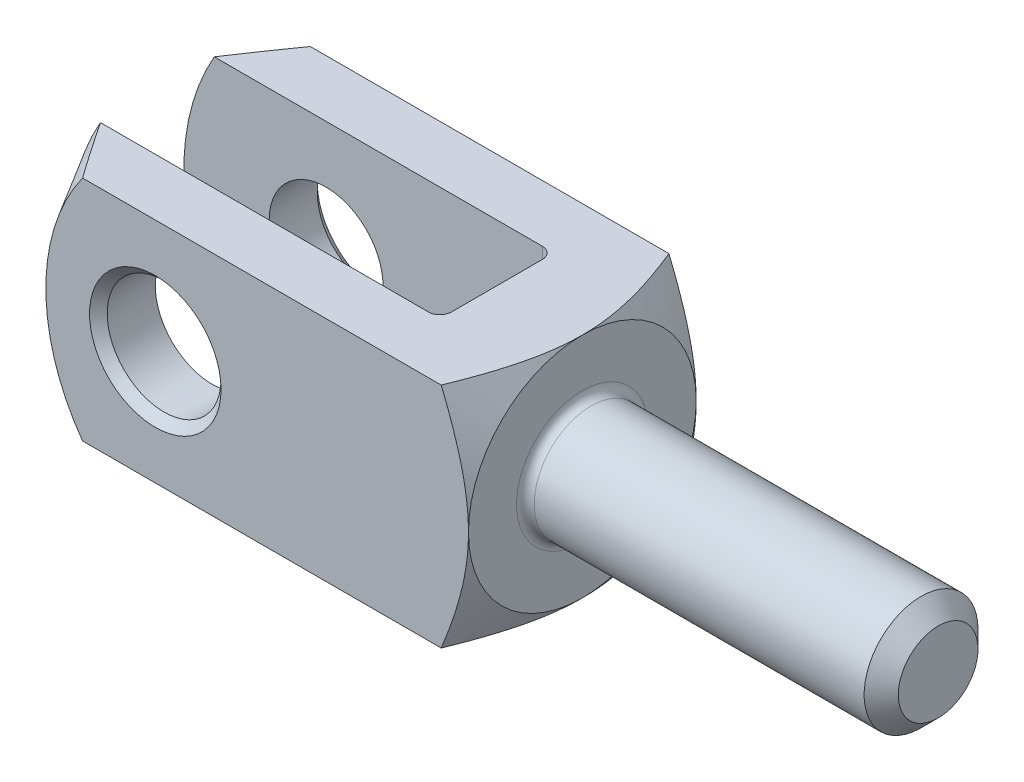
ISO-10303-21;
HEADER;
FILE_DESCRIPTION(('STEP AP214'),'2;1');
FILE_NAME('part.step','',(''),(''),'','','');
FILE_SCHEMA(('AUTOMOTIVE_DESIGN { 1 0 10303 214 1 1 1 1 }'));
ENDSEC;
DATA;
#1=APPLICATION_CONTEXT('core data for automotive mechanical design processes');
#2=APPLICATION_PROTOCOL_DEFINITION('international standard','automotive_design',2000,#1);
#3=PRODUCT_CONTEXT('',#1,'mechanical');
#4=PRODUCT('Part','Part','',(#3));
#5=PRODUCT_RELATED_PRODUCT_CATEGORY('part','',(#4));
#6=PRODUCT_DEFINITION_FORMATION('','',#4);
#7=PRODUCT_DEFINITION_CONTEXT('part definition',#1,'design');
#8=PRODUCT_DEFINITION('design','',#6,#7);
#9=PRODUCT_DEFINITION_SHAPE('','',#8);
#10=(LENGTH_UNIT() NAMED_UNIT(*) SI_UNIT(.MILLI.,.METRE.));
#11=(NAMED_UNIT(*) PLANE_ANGLE_UNIT() SI_UNIT($,.RADIAN.));
#12=(NAMED_UNIT(*) SI_UNIT($,.STERADIAN.) SOLID_ANGLE_UNIT());
#13=UNCERTAINTY_MEASURE_WITH_UNIT(LENGTH_MEASURE(1.E-05),#10,'distance_accuracy_value','');
#14=(GEOMETRIC_REPRESENTATION_CONTEXT(3) GLOBAL_UNCERTAINTY_ASSIGNED_CONTEXT((#13)) GLOBAL_UNIT_ASSIGNED_CONTEXT((#10,
#11,#12)) REPRESENTATION_CONTEXT('',''));
#15=CARTESIAN_POINT('',(0.,0.,0.));
#16=DIRECTION('',(0.,0.,1.));
#17=DIRECTION('',(1.,0.,0.));
#18=AXIS2_PLACEMENT_3D('',#15,#16,#17);
#19=CARTESIAN_POINT('',(-57.,-8.,-3.99999999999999));
#20=DIRECTION('',(0.,0.,-1.));
#21=DIRECTION('',(-1.,0.,0.));
#22=AXIS2_PLACEMENT_3D('',#19,#20,#21);
#23=PLANE('',#22);
#24=CARTESIAN_POINT('',(-47.,0.,-3.99999999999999));
#25=DIRECTION('',(0.,0.,-1.));
#26=DIRECTION('',(-1.,0.,0.));
#27=AXIS2_PLACEMENT_3D('',#24,#25,#26);
#28=CIRCLE('',#27,4.00000000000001);
#29=CARTESIAN_POINT('',(-51.,0.,-3.99999999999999));
#30=VERTEX_POINT('',#29);
#31=EDGE_CURVE('E160',#30,#30,#28,.F.);
#32=ORIENTED_EDGE('',*,*,#31,.F.);
#33=EDGE_LOOP('',(#32));
#34=FACE_BOUND('',#33,.T.);
#35=DIRECTION('',(-1.,0.,0.));
#36=VECTOR('',#35,1.);
#37=CARTESIAN_POINT('',(-57.,8.,-3.99999999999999));
#38=LINE('',#37,#36);
#39=CARTESIAN_POINT('',(-31.8,8.,-3.99999999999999));
#40=VERTEX_POINT('',#39);
#41=CARTESIAN_POINT('',(-54.856406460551,8.,-3.99999999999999));
#42=VERTEX_POINT('',#41);
#43=EDGE_CURVE('E321',#40,#42,#38,.T.);
#44=ORIENTED_EDGE('',*,*,#43,.T.);
#45=CARTESIAN_POINT('',(-41.,0.,-3.99999999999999));
#46=DIRECTION('',(0.,0.,1.));
#47=DIRECTION('',(1.,0.,0.));
#48=AXIS2_PLACEMENT_3D('',#45,#46,#47);
#49=CIRCLE('',#48,16.);
#50=CARTESIAN_POINT('',(-54.856406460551,-8.,-3.99999999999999));
#51=VERTEX_POINT('',#50);
#52=EDGE_CURVE('E61',#42,#51,#49,.T.);
#53=ORIENTED_EDGE('',*,*,#52,.T.);
#54=DIRECTION('',(-1.,0.,0.));
#55=VECTOR('',#54,1.);
#56=CARTESIAN_POINT('',(-57.,-8.,-3.99999999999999));
#57=LINE('',#56,#55);
#58=CARTESIAN_POINT('',(-31.8,-8.,-3.99999999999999));
#59=VERTEX_POINT('',#58);
#60=EDGE_CURVE('E311',#59,#51,#57,.T.);
#61=ORIENTED_EDGE('',*,*,#60,.F.);
#62=DIRECTION('',(0.,1.,0.));
#63=VECTOR('',#62,1.);
#64=CARTESIAN_POINT('',(-31.8,8.,-3.99999999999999));
#65=LINE('',#64,#63);
#66=EDGE_CURVE('E183',#59,#40,#65,.T.);
#67=ORIENTED_EDGE('',*,*,#66,.T.);
#68=EDGE_LOOP('',(#44,#53,#61,#67));
#69=FACE_BOUND('',#68,.T.);
#70=ADVANCED_FACE('F37',(#34,#69),#23,.F.);
#71=CARTESIAN_POINT('',(-57.,-8.,4.00000000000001));
#72=DIRECTION('',(0.,0.,1.));
#73=DIRECTION('',(1.,0.,0.));
#74=AXIS2_PLACEMENT_3D('',#71,#72,#73);
#75=PLANE('',#74);
#76=CARTESIAN_POINT('',(-47.,0.,4.00000000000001));
#77=DIRECTION('',(0.,0.,1.));
#78=DIRECTION('',(1.,0.,0.));
#79=AXIS2_PLACEMENT_3D('',#76,#77,#78);
#80=CIRCLE('',#79,4.00000000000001);
#81=CARTESIAN_POINT('',(-43.,0.,4.));
#82=VERTEX_POINT('',#81);
#83=EDGE_CURVE('E164',#82,#82,#80,.F.);
#84=ORIENTED_EDGE('',*,*,#83,.F.);
#85=EDGE_LOOP('',(#84));
#86=FACE_BOUND('',#85,.T.);
#87=CARTESIAN_POINT('',(-41.,0.,4.00000000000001));
#88=DIRECTION('',(0.,0.,1.));
#89=DIRECTION('',(1.,0.,0.));
#90=AXIS2_PLACEMENT_3D('',#87,#88,#89);
#91=CIRCLE('',#90,16.);
#92=CARTESIAN_POINT('',(-54.856406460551,8.,4.00000000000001));
#93=VERTEX_POINT('',#92);
#94=CARTESIAN_POINT('',(-54.856406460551,-8.,4.00000000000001));
#95=VERTEX_POINT('',#94);
#96=EDGE_CURVE('E128',#93,#95,#91,.T.);
#97=ORIENTED_EDGE('',*,*,#96,.F.);
#98=DIRECTION('',(1.,0.,0.));
#99=VECTOR('',#98,1.);
#100=CARTESIAN_POINT('',(-57.,8.,4.00000000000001));
#101=LINE('',#100,#99);
#102=CARTESIAN_POINT('',(-31.8,8.,4.));
#103=VERTEX_POINT('',#102);
#104=EDGE_CURVE('E325',#93,#103,#101,.T.);
#105=ORIENTED_EDGE('',*,*,#104,.T.);
#106=DIRECTION('',(0.,1.,0.));
#107=VECTOR('',#106,1.);
#108=CARTESIAN_POINT('',(-31.8,-8.,4.));
#109=LINE('',#108,#107);
#110=CARTESIAN_POINT('',(-31.8,-8.,4.));
#111=VERTEX_POINT('',#110);
#112=EDGE_CURVE('E179',#103,#111,#109,.F.);
#113=ORIENTED_EDGE('',*,*,#112,.T.);
#114=DIRECTION('',(1.,0.,0.));
#115=VECTOR('',#114,1.);
#116=CARTESIAN_POINT('',(-57.,-8.,4.00000000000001));
#117=LINE('',#116,#115);
#118=EDGE_CURVE('E314',#95,#111,#117,.T.);
#119=ORIENTED_EDGE('',*,*,#118,.F.);
#120=EDGE_LOOP('',(#97,#105,#113,#119));
#121=FACE_BOUND('',#120,.T.);
#122=ADVANCED_FACE('F386',(#86,#121),#75,.F.);
#123=CARTESIAN_POINT('',(-57.,-8.,8.));
#124=DIRECTION('',(0.,0.,1.));
#125=DIRECTION('',(1.,0.,0.));
#126=AXIS2_PLACEMENT_3D('',#123,#124,#125);
#127=PLANE('',#126);
#128=CARTESIAN_POINT('',(-47.,0.,8.));
#129=DIRECTION('',(0.,0.,1.));
#130=DIRECTION('',(1.,0.,0.));
#131=AXIS2_PLACEMENT_3D('',#128,#129,#130);
#132=CIRCLE('',#131,4.62);
#133=CARTESIAN_POINT('',(-42.38,0.,8.));
#134=VERTEX_POINT('',#133);
#135=EDGE_CURVE('E219',#134,#134,#132,.F.);
#136=ORIENTED_EDGE('',*,*,#135,.T.);
#137=EDGE_LOOP('',(#136));
#138=FACE_BOUND('',#137,.T.);
#139=DIRECTION('',(1.,0.,0.));
#140=VECTOR('',#139,1.);
#141=CARTESIAN_POINT('',(-57.,8.,8.));
#142=LINE('',#141,#140);
#143=CARTESIAN_POINT('',(-52.1100179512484,8.,8.));
#144=VERTEX_POINT('',#143);
#145=CARTESIAN_POINT('',(-26.9131704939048,8.,8.));
#146=VERTEX_POINT('',#145);
#147=EDGE_CURVE('E142',#144,#146,#142,.T.);
#148=ORIENTED_EDGE('',*,*,#147,.F.);
#149=CARTESIAN_POINT('',(-41.,0.,8.));
#150=DIRECTION('',(0.,0.,1.));
#151=DIRECTION('',(1.,0.,0.));
#152=AXIS2_PLACEMENT_3D('',#149,#150,#151);
#153=CIRCLE('',#152,13.6905989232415);
#154=CARTESIAN_POINT('',(-52.1100179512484,-8.,8.));
#155=VERTEX_POINT('',#154);
#156=EDGE_CURVE('E53',#144,#155,#153,.T.);
#157=ORIENTED_EDGE('',*,*,#156,.T.);
#158=DIRECTION('',(1.,0.,0.));
#159=VECTOR('',#158,1.);
#160=CARTESIAN_POINT('',(-57.,-8.,8.));
#161=LINE('',#160,#159);
#162=CARTESIAN_POINT('',(-26.9131704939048,-8.,8.));
#163=VERTEX_POINT('',#162);
#164=EDGE_CURVE('E139',#155,#163,#161,.T.);
#165=ORIENTED_EDGE('',*,*,#164,.T.);
#166=CARTESIAN_POINT('',(-30.8846987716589,-16.3392348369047,8.));
#167=CARTESIAN_POINT('',(-30.6802772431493,-15.9449469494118,8.));
#168=CARTESIAN_POINT('',(-30.4769364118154,-15.5500935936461,8.));
#169=CARTESIAN_POINT('',(-30.0729892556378,-14.7589649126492,8.));
#170=CARTESIAN_POINT('',(-29.8723830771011,-14.3626895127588,8.));
#171=CARTESIAN_POINT('',(-29.474153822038,-13.56777616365,8.));
#172=CARTESIAN_POINT('',(-29.2765365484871,-13.1691353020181,8.));
#173=CARTESIAN_POINT('',(-28.88546114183,-12.3698241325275,8.));
#174=CARTESIAN_POINT('',(-28.6920029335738,-11.9691538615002,8.));
#175=CARTESIAN_POINT('',(-28.2985635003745,-11.1406012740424,8.));
#176=CARTESIAN_POINT('',(-28.0989132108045,-10.7125613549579,8.));
#177=CARTESIAN_POINT('',(-27.7072115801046,-9.85297670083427,8.));
#178=CARTESIAN_POINT('',(-27.5151606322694,-9.42143178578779,8.));
#179=CARTESIAN_POINT('',(-27.1411578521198,-8.55419814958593,8.));
#180=CARTESIAN_POINT('',(-26.959201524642,-8.11851137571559,8.));
#181=CARTESIAN_POINT('',(-26.6086480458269,-7.24179288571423,8.));
#182=CARTESIAN_POINT('',(-26.4400493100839,-6.80076181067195,8.));
#183=CARTESIAN_POINT('',(-26.1834024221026,-6.08615976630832,8.));
#184=CARTESIAN_POINT('',(-26.0896630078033,-5.81463561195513,8.));
#185=CARTESIAN_POINT('',(-25.9102546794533,-5.2689424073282,8.));
#186=CARTESIAN_POINT('',(-25.8245850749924,-4.99477358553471,8.));
#187=CARTESIAN_POINT('',(-25.6629013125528,-4.44359021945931,8.));
#188=CARTESIAN_POINT('',(-25.5868869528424,-4.16657573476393,8.));
#189=CARTESIAN_POINT('',(-25.4463305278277,-3.60962774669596,8.));
#190=CARTESIAN_POINT('',(-25.3817883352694,-3.32969427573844,8.));
#191=CARTESIAN_POINT('',(-25.267479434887,-2.77364565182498,8.));
#192=CARTESIAN_POINT('',(-25.2174014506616,-2.49759512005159,8.));
#193=CARTESIAN_POINT('',(-25.1318063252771,-1.94322662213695,8.));
#194=CARTESIAN_POINT('',(-25.0962887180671,-1.66490872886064,8.));
#195=CARTESIAN_POINT('',(-25.0412989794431,-1.10685523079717,8.));
#196=CARTESIAN_POINT('',(-25.0218163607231,-0.827120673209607,8.));
#197=CARTESIAN_POINT('',(-24.9997560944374,-0.266983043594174,8.));
#198=CARTESIAN_POINT('',(-24.9971778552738,0.013420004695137,8.));
#199=CARTESIAN_POINT('',(-25.0086102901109,0.553432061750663,8.));
#200=CARTESIAN_POINT('',(-25.0214258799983,0.8130674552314,8.));
#201=CARTESIAN_POINT('',(-25.0611642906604,1.3312448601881,8.));
#202=CARTESIAN_POINT('',(-25.0880870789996,1.58978687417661,8.));
#203=CARTESIAN_POINT('',(-25.155052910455,2.10528244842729,8.));
#204=CARTESIAN_POINT('',(-25.195102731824,2.36223511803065,8.));
#205=CARTESIAN_POINT('',(-25.2870021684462,2.87400792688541,8.));
#206=CARTESIAN_POINT('',(-25.3388521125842,3.12882800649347,8.));
#207=CARTESIAN_POINT('',(-25.4545600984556,3.64346290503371,8.));
#208=CARTESIAN_POINT('',(-25.518722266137,3.90320881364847,8.));
#209=CARTESIAN_POINT('',(-25.6564654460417,4.42017468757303,8.));
#210=CARTESIAN_POINT('',(-25.7300465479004,4.67739462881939,8.));
#211=CARTESIAN_POINT('',(-25.8852035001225,5.18938513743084,8.));
#212=CARTESIAN_POINT('',(-25.9667789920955,5.44415581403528,8.));
#213=CARTESIAN_POINT('',(-26.1366771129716,5.95141147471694,8.));
#214=CARTESIAN_POINT('',(-26.224999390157,6.20389657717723,8.));
#215=CARTESIAN_POINT('',(-26.4147611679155,6.72729225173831,8.));
#216=CARTESIAN_POINT('',(-26.5166830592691,6.99802735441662,8.));
#217=CARTESIAN_POINT('',(-26.7260618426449,7.5373553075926,8.));
#218=CARTESIAN_POINT('',(-26.8335190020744,7.80594805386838,8.));
#219=CARTESIAN_POINT('',(-27.0530704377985,8.3412927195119,8.));
#220=CARTESIAN_POINT('',(-27.1651656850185,8.60804423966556,8.));
#221=CARTESIAN_POINT('',(-27.3932328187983,9.13988748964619,8.));
#222=CARTESIAN_POINT('',(-27.5092047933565,9.40497918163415,8.));
#223=CARTESIAN_POINT('',(-27.8621889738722,10.1985259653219,8.));
#224=CARTESIAN_POINT('',(-28.1040848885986,10.7248088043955,8.));
#225=CARTESIAN_POINT('',(-28.5972155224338,11.7728810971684,8.));
#226=CARTESIAN_POINT('',(-28.8484492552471,12.2946710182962,8.));
#227=CARTESIAN_POINT('',(-29.3586491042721,13.3364224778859,8.));
#228=CARTESIAN_POINT('',(-29.6176364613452,13.8563735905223,8.));
#229=CARTESIAN_POINT('',(-30.1409123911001,14.8936090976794,8.));
#230=CARTESIAN_POINT('',(-30.4052010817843,15.4108934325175,8.));
#231=CARTESIAN_POINT('',(-30.9377393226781,16.4430931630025,8.));
#232=CARTESIAN_POINT('',(-31.2059868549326,16.9580096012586,8.));
#233=CARTESIAN_POINT('',(-31.7457004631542,17.9861456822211,8.));
#234=CARTESIAN_POINT('',(-32.0171665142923,18.4993653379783,8.));
#235=CARTESIAN_POINT('',(-32.754394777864,19.8847467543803,8.));
#236=CARTESIAN_POINT('',(-33.2225895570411,20.7556134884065,8.));
#237=CARTESIAN_POINT('',(-34.164259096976,22.494640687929,8.));
#238=CARTESIAN_POINT('',(-34.6377345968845,23.3628007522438,8.));
#239=CARTESIAN_POINT('',(-35.5857843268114,25.0920581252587,8.));
#240=CARTESIAN_POINT('',(-36.0603367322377,25.9531674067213,8.));
#241=CARTESIAN_POINT('',(-36.7742624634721,27.2435811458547,8.));
#242=CARTESIAN_POINT('',(-37.0125683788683,27.6734768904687,8.));
#243=CARTESIAN_POINT('',(-37.4898082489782,28.5329190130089,8.));
#244=CARTESIAN_POINT('',(-37.7287422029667,28.9624653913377,8.));
#245=CARTESIAN_POINT('',(-37.9679488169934,29.3918599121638,8.));
#246=B_SPLINE_CURVE_WITH_KNOTS('',3,(#166,#167,#168,#169,#170,#171,#172,#173,#174,#175,#176,
#177,#178,#179,#180,#181,#182,#183,#184,#185,#186,#187,#188,#189,#190,#191,#192,#193,#194,#195,
#196,#197,#198,#199,#200,#201,#202,#203,#204,#205,#206,#207,#208,#209,#210,#211,#212,#213,#214,
#215,#216,#217,#218,#219,#220,#221,#222,#223,#224,#225,#226,#227,#228,#229,#230,#231,#232,#233,
#234,#235,#236,#237,#238,#239,#240,#241,#242,#243,#244,#245),.UNSPECIFIED.,.F.,.F.,(4,2,2,2,2,2,
2,2,2,2,2,2,2,2,2,2,2,2,2,2,2,2,2,2,2,2,2,2,2,2,2,2,2,2,2,2,2,2,2,4),(0.,1.33239397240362,
2.66485895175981,3.99964423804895,5.33440538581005,6.7512847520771,8.16823735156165,
9.58455382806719,11.0007020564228,11.8623516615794,12.7239274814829,13.5854852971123,
14.4470335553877,15.2883577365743,16.1296549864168,16.9704015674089,17.8111187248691,
18.590575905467,19.3700312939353,20.149889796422,20.9297700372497,21.732223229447,
22.5346840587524,23.3371089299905,24.139491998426,25.0072719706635,25.8750939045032,
26.7430984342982,27.6111226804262,29.3486130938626,31.085920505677,32.8285250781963,
34.5711684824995,36.3129523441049,38.0547227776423,41.0209268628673,43.9875514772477,
46.9371849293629,48.4117694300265,49.8863522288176),.UNSPECIFIED.);
#247=CARTESIAN_POINT('',(-25.,0.,8.));
#248=VERTEX_POINT('',#247);
#249=EDGE_CURVE('E283',#248,#163,#246,.F.);
#250=ORIENTED_EDGE('',*,*,#249,.F.);
#251=EDGE_CURVE('E281',#146,#248,#246,.F.);
#252=ORIENTED_EDGE('',*,*,#251,.F.);
#253=EDGE_LOOP('',(#148,#157,#165,#250,#252));
#254=FACE_BOUND('',#253,.T.);
#255=ADVANCED_FACE('F137',(#138,#254),#127,.T.);
#256=CARTESIAN_POINT('',(-57.,-8.,8.));
#257=DIRECTION('',(0.,-1.,0.));
#258=DIRECTION('',(0.,0.,-1.));
#259=AXIS2_PLACEMENT_3D('',#256,#257,#258);
#260=PLANE('',#259);
#261=ORIENTED_EDGE('',*,*,#60,.T.);
#262=CARTESIAN_POINT('',(-61.1857767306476,-8.,5.89565350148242));
#263=CARTESIAN_POINT('',(-60.7965292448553,-8.,5.2689297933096));
#264=CARTESIAN_POINT('',(-60.4062157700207,-8.,4.64286516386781));
#265=CARTESIAN_POINT('',(-59.6229580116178,-8.,3.39236663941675));
#266=CARTESIAN_POINT('',(-59.2300136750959,-8.,2.76793277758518));
#267=CARTESIAN_POINT('',(-58.4405400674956,-8.,1.52028939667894));
#268=CARTESIAN_POINT('',(-58.0440070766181,-8.,0.897082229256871));
#269=CARTESIAN_POINT('',(-57.2471530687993,-8.,-0.346899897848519));
#270=CARTESIAN_POINT('',(-56.8468320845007,-8.,-0.967674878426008));
#271=CARTESIAN_POINT('',(-56.0247666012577,-8.,-2.23198790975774));
#272=CARTESIAN_POINT('',(-55.6028241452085,-8.,-2.87539744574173));
#273=CARTESIAN_POINT('',(-54.7525673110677,-8.,-4.15798891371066));
#274=CARTESIAN_POINT('',(-54.3242529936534,-8.,-4.79717088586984));
#275=CARTESIAN_POINT('',(-53.4597392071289,-8.,-6.06950936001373));
#276=CARTESIAN_POINT('',(-53.0235458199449,-8.,-6.70266997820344));
#277=CARTESIAN_POINT('',(-52.3611233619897,-8.,-7.64668569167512));
#278=CARTESIAN_POINT('',(-52.1389647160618,-8.,-7.96039757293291));
#279=CARTESIAN_POINT('',(-51.6914753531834,-8.,-8.58554886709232));
#280=CARTESIAN_POINT('',(-51.4661446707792,-8.,-8.89698830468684));
#281=CARTESIAN_POINT('',(-51.0138777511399,-8.,-9.51426261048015));
#282=CARTESIAN_POINT('',(-50.7869759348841,-8.,-9.82012266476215));
#283=CARTESIAN_POINT('',(-50.3288611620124,-8.,-10.4285917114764));
#284=CARTESIAN_POINT('',(-50.0976483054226,-8.,-10.7312007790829));
#285=CARTESIAN_POINT('',(-49.6297403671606,-8.,-11.3328374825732));
#286=CARTESIAN_POINT('',(-49.3930380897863,-8.,-11.6318595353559));
#287=CARTESIAN_POINT('',(-48.9133962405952,-8.,-12.2248466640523));
#288=CARTESIAN_POINT('',(-48.6704570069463,-8.,-12.5188120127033));
#289=CARTESIAN_POINT('',(-48.1794855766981,-8.,-13.0972598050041));
#290=CARTESIAN_POINT('',(-47.9315323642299,-8.,-13.3818089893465));
#291=CARTESIAN_POINT('',(-47.426285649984,-8.,-13.9426547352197));
#292=CARTESIAN_POINT('',(-47.1689897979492,-8.,-14.2189491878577));
#293=CARTESIAN_POINT('',(-46.6433260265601,-8.,-14.7597258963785));
#294=CARTESIAN_POINT('',(-46.3749843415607,-8.,-15.0242333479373));
#295=CARTESIAN_POINT('',(-45.96154330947,-8.,-15.4091163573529));
#296=CARTESIAN_POINT('',(-45.8219428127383,-8.,-15.5354022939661));
#297=CARTESIAN_POINT('',(-45.5385996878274,-8.,-15.783226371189));
#298=CARTESIAN_POINT('',(-45.3948575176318,-8.,-15.9047650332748));
#299=CARTESIAN_POINT('',(-45.0975226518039,-8.,-16.1463249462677));
#300=CARTESIAN_POINT('',(-44.943761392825,-8.,-16.2661397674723));
#301=CARTESIAN_POINT('',(-44.63058322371,-8.,-16.4982387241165));
#302=CARTESIAN_POINT('',(-44.4711652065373,-8.,-16.6105213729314));
#303=CARTESIAN_POINT('',(-44.1461892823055,-8.,-16.8256372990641));
#304=CARTESIAN_POINT('',(-43.980636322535,-8.,-16.9284779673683));
#305=CARTESIAN_POINT('',(-43.6428904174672,-8.,-17.12246219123));
#306=CARTESIAN_POINT('',(-43.4706992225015,-8.,-17.2136088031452));
#307=CARTESIAN_POINT('',(-43.0236575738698,-8.,-17.427073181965));
#308=CARTESIAN_POINT('',(-42.7438013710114,-8.,-17.539468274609));
#309=CARTESIAN_POINT('',(-42.3134448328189,-8.,-17.6730277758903));
#310=CARTESIAN_POINT('',(-42.1682897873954,-8.,-17.7117004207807));
#311=CARTESIAN_POINT('',(-41.8750748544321,-8.,-17.7760297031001));
#312=CARTESIAN_POINT('',(-41.7270150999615,-8.,-17.8016869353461));
#313=CARTESIAN_POINT('',(-41.4276254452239,-8.,-17.839058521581));
#314=CARTESIAN_POINT('',(-41.2762776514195,-8.,-17.8506309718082));
#315=CARTESIAN_POINT('',(-40.9731780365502,-8.,-17.8588139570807));
#316=CARTESIAN_POINT('',(-40.8214262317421,-8.,-17.8554250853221));
#317=CARTESIAN_POINT('',(-40.5189603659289,-8.,-17.8338479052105));
#318=CARTESIAN_POINT('',(-40.3682465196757,-8.,-17.8156566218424));
#319=CARTESIAN_POINT('',(-40.0691796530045,-8.,-17.765312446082));
#320=CARTESIAN_POINT('',(-39.9208270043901,-8.,-17.7331573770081));
#321=CARTESIAN_POINT('',(-39.6002883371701,-8.,-17.6490655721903));
#322=CARTESIAN_POINT('',(-39.4287768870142,-8.,-17.5945681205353));
#323=CARTESIAN_POINT('',(-39.0913326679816,-8.,-17.47036463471));
#324=CARTESIAN_POINT('',(-38.9254030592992,-8.,-17.400650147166));
#325=CARTESIAN_POINT('',(-38.5990125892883,-8.,-17.2483781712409));
#326=CARTESIAN_POINT('',(-38.4385691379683,-8.,-17.1657837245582));
#327=CARTESIAN_POINT('',(-38.12355142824,-8.,-16.9902060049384));
#328=CARTESIAN_POINT('',(-37.9689765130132,-8.,-16.897223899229));
#329=CARTESIAN_POINT('',(-37.6154702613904,-8.,-16.6708821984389));
#330=CARTESIAN_POINT('',(-37.4186208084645,-8.,-16.534282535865));
#331=CARTESIAN_POINT('',(-37.0333734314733,-8.,-16.2495879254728));
#332=CARTESIAN_POINT('',(-36.8449795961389,-8.,-16.1014875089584));
#333=CARTESIAN_POINT('',(-36.4752188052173,-8.,-15.7961052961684));
#334=CARTESIAN_POINT('',(-36.2938660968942,-8.,-15.6388063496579));
#335=CARTESIAN_POINT('',(-35.9375595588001,-8.,-15.3172162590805));
#336=CARTESIAN_POINT('',(-35.7626046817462,-8.,-15.152926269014));
#337=CARTESIAN_POINT('',(-35.4170062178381,-8.,-14.8176183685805));
#338=CARTESIAN_POINT('',(-35.2463993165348,-8.,-14.6465627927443));
#339=CARTESIAN_POINT('',(-34.9099413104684,-8.,-14.2998402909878));
#340=CARTESIAN_POINT('',(-34.744090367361,-8.,-14.1241732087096));
#341=CARTESIAN_POINT('',(-34.4166747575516,-8.,-13.7692439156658));
#342=CARTESIAN_POINT('',(-34.2551057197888,-8.,-13.589985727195));
#343=CARTESIAN_POINT('',(-33.9355274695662,-8.,-13.2283206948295));
#344=CARTESIAN_POINT('',(-33.7775183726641,-8.,-13.0459137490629));
#345=CARTESIAN_POINT('',(-33.3998299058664,-8.,-12.6023889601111));
#346=CARTESIAN_POINT('',(-33.1817025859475,-8.,-12.3399501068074));
#347=CARTESIAN_POINT('',(-32.7505813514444,-8.,-11.8108173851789));
#348=CARTESIAN_POINT('',(-32.5375884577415,-8.,-11.5441226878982));
#349=CARTESIAN_POINT('',(-32.1191841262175,-8.,-11.0114334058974));
#350=CARTESIAN_POINT('',(-31.9137065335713,-8.,-10.7454906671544));
#351=CARTESIAN_POINT('',(-31.5064326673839,-8.,-10.2109265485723));
#352=CARTESIAN_POINT('',(-31.3046352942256,-8.,-9.9423060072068));
#353=CARTESIAN_POINT('',(-31.1043464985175,-8.,-9.67257983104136));
#354=B_SPLINE_CURVE_WITH_KNOTS('',3,(#262,#263,#264,#265,#266,#267,#268,#269,#270,#271,#272,
#273,#274,#275,#276,#277,#278,#279,#280,#281,#282,#283,#284,#285,#286,#287,#288,#289,#290,#291,
#292,#293,#294,#295,#296,#297,#298,#299,#300,#301,#302,#303,#304,#305,#306,#307,#308,#309,#310,
#311,#312,#313,#314,#315,#316,#317,#318,#319,#320,#321,#322,#323,#324,#325,#326,#327,#328,#329,
#330,#331,#332,#333,#334,#335,#336,#337,#338,#339,#340,#341,#342,#343,#344,#345,#346,#347,#348,
#349,#350,#351,#352,#353),.UNSPECIFIED.,.F.,.F.,(4,2,2,2,2,2,2,2,2,2,2,2,2,2,2,2,2,2,2,2,2,2,2,
2,2,2,2,2,2,2,2,2,2,2,2,2,2,2,2,2,2,2,2,2,2,4),(0.,2.21329571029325,4.42663610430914,
6.6426188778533,8.85858257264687,11.1668200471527,13.4750355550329,15.781539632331,
16.9347484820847,18.0879447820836,19.2304162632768,20.3728612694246,21.5168995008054,
22.6608758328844,23.7929840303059,24.9253790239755,26.0552243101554,26.619877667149,
27.184468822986,27.7690691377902,28.3537844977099,28.9380381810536,29.5221388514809,
30.4231831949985,30.873351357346,31.3234989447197,31.778145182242,32.2327733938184,
32.6874929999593,33.1422835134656,33.6813034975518,34.2206236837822,34.7615209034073,
35.3023574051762,36.0205977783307,36.7391817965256,37.459151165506,38.1790021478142,
38.9036703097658,39.6283630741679,40.3522850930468,41.076230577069,42.0999043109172,
43.1237799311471,44.1319728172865,45.1398593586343),.UNSPECIFIED.);
#355=CARTESIAN_POINT('',(-52.1100179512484,-8.,-8.));
#356=VERTEX_POINT('',#355);
#357=EDGE_CURVE('E133',#51,#356,#354,.T.);
#358=ORIENTED_EDGE('',*,*,#357,.T.);
#359=DIRECTION('',(1.,0.,0.));
#360=VECTOR('',#359,1.);
#361=CARTESIAN_POINT('',(-57.,-8.,-8.));
#362=LINE('',#361,#360);
#363=CARTESIAN_POINT('',(-26.9131704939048,-8.,-8.));
#364=VERTEX_POINT('',#363);
#365=EDGE_CURVE('E152',#356,#364,#362,.T.);
#366=ORIENTED_EDGE('',*,*,#365,.T.);
#367=CARTESIAN_POINT('',(-30.8846987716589,-8.,-16.3392348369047));
#368=CARTESIAN_POINT('',(-30.6802772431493,-8.,-15.9449469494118));
#369=CARTESIAN_POINT('',(-30.4769364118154,-8.,-15.5500935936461));
#370=CARTESIAN_POINT('',(-30.0729892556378,-8.,-14.7589649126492));
#371=CARTESIAN_POINT('',(-29.8723830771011,-8.,-14.3626895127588));
#372=CARTESIAN_POINT('',(-29.474153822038,-8.,-13.56777616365));
#373=CARTESIAN_POINT('',(-29.2765365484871,-8.,-13.1691353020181));
#374=CARTESIAN_POINT('',(-28.88546114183,-8.,-12.3698241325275));
#375=CARTESIAN_POINT('',(-28.6920029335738,-8.,-11.9691538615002));
#376=CARTESIAN_POINT('',(-28.2985635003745,-8.,-11.1406012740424));
#377=CARTESIAN_POINT('',(-28.0989132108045,-8.,-10.7125613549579));
#378=CARTESIAN_POINT('',(-27.7072115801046,-8.,-9.85297670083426));
#379=CARTESIAN_POINT('',(-27.5151606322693,-8.,-9.42143178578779));
#380=CARTESIAN_POINT('',(-27.1411578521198,-8.,-8.55419814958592));
#381=CARTESIAN_POINT('',(-26.959201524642,-8.,-8.11851137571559));
#382=CARTESIAN_POINT('',(-26.6086480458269,-8.,-7.24179288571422));
#383=CARTESIAN_POINT('',(-26.4400493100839,-8.,-6.80076181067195));
#384=CARTESIAN_POINT('',(-26.1834024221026,-8.,-6.08615976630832));
#385=CARTESIAN_POINT('',(-26.0896630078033,-8.,-5.81463561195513));
#386=CARTESIAN_POINT('',(-25.9102546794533,-8.,-5.2689424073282));
#387=CARTESIAN_POINT('',(-25.8245850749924,-8.,-4.99477358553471));
#388=CARTESIAN_POINT('',(-25.6629013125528,-8.,-4.44359021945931));
#389=CARTESIAN_POINT('',(-25.5868869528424,-8.,-4.16657573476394));
#390=CARTESIAN_POINT('',(-25.4463305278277,-8.,-3.60962774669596));
#391=CARTESIAN_POINT('',(-25.3817883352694,-8.,-3.32969427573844));
#392=CARTESIAN_POINT('',(-25.267479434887,-8.,-2.77364565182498));
#393=CARTESIAN_POINT('',(-25.2174014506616,-8.,-2.49759512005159));
#394=CARTESIAN_POINT('',(-25.1318063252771,-8.,-1.94322662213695));
#395=CARTESIAN_POINT('',(-25.0962887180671,-8.,-1.66490872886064));
#396=CARTESIAN_POINT('',(-25.0412989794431,-8.,-1.10685523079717));
#397=CARTESIAN_POINT('',(-25.0218163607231,-8.,-0.827120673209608));
#398=CARTESIAN_POINT('',(-24.9997560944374,-8.,-0.266983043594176));
#399=CARTESIAN_POINT('',(-24.9971778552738,-8.,0.013420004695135));
#400=CARTESIAN_POINT('',(-25.0086102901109,-8.,0.553432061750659));
#401=CARTESIAN_POINT('',(-25.0214258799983,-8.,0.813067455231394));
#402=CARTESIAN_POINT('',(-25.0611642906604,-8.,1.3312448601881));
#403=CARTESIAN_POINT('',(-25.0880870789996,-8.,1.5897868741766));
#404=CARTESIAN_POINT('',(-25.155052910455,-8.,2.10528244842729));
#405=CARTESIAN_POINT('',(-25.195102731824,-8.,2.36223511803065));
#406=CARTESIAN_POINT('',(-25.2870021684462,-8.,2.87400792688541));
#407=CARTESIAN_POINT('',(-25.3388521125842,-8.,3.12882800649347));
#408=CARTESIAN_POINT('',(-25.4545600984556,-8.,3.6434629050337));
#409=CARTESIAN_POINT('',(-25.518722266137,-8.,3.90320881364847));
#410=CARTESIAN_POINT('',(-25.6564654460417,-8.,4.42017468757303));
#411=CARTESIAN_POINT('',(-25.7300465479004,-8.,4.67739462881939));
#412=CARTESIAN_POINT('',(-25.8852035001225,-8.,5.18938513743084));
#413=CARTESIAN_POINT('',(-25.9667789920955,-8.,5.44415581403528));
#414=CARTESIAN_POINT('',(-26.1366771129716,-8.,5.95141147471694));
#415=CARTESIAN_POINT('',(-26.224999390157,-8.,6.20389657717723));
#416=CARTESIAN_POINT('',(-26.4147611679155,-8.,6.7272922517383));
#417=CARTESIAN_POINT('',(-26.5166830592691,-8.,6.99802735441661));
#418=CARTESIAN_POINT('',(-26.7260618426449,-8.,7.53735530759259));
#419=CARTESIAN_POINT('',(-26.8335190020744,-8.,7.80594805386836));
#420=CARTESIAN_POINT('',(-27.0530704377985,-8.,8.34129271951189));
#421=CARTESIAN_POINT('',(-27.1651656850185,-8.,8.60804423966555));
#422=CARTESIAN_POINT('',(-27.3932328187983,-8.,9.13988748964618));
#423=CARTESIAN_POINT('',(-27.5092047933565,-8.,9.40497918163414));
#424=CARTESIAN_POINT('',(-27.8621889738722,-8.,10.1985259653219));
#425=CARTESIAN_POINT('',(-28.1040848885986,-8.,10.7248088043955));
#426=CARTESIAN_POINT('',(-28.5972155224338,-8.,11.7728810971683));
#427=CARTESIAN_POINT('',(-28.8484492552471,-8.,12.2946710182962));
#428=CARTESIAN_POINT('',(-29.3586491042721,-8.,13.3364224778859));
#429=CARTESIAN_POINT('',(-29.6176364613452,-8.,13.8563735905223));
#430=CARTESIAN_POINT('',(-30.1409123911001,-8.,14.8936090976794));
#431=CARTESIAN_POINT('',(-30.4052010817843,-8.,15.4108934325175));
#432=CARTESIAN_POINT('',(-30.9377393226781,-8.,16.4430931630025));
#433=CARTESIAN_POINT('',(-31.2059868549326,-8.,16.9580096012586));
#434=CARTESIAN_POINT('',(-31.7457004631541,-8.,17.9861456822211));
#435=CARTESIAN_POINT('',(-32.0171665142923,-8.,18.4993653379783));
#436=CARTESIAN_POINT('',(-32.7543947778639,-8.,19.8847467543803));
#437=CARTESIAN_POINT('',(-33.2225895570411,-8.,20.7556134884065));
#438=CARTESIAN_POINT('',(-34.164259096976,-8.,22.494640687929));
#439=CARTESIAN_POINT('',(-34.6377345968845,-8.,23.3628007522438));
#440=CARTESIAN_POINT('',(-35.5857843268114,-8.,25.0920581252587));
#441=CARTESIAN_POINT('',(-36.0603367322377,-8.,25.9531674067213));
#442=CARTESIAN_POINT('',(-36.7742624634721,-8.,27.2435811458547));
#443=CARTESIAN_POINT('',(-37.0125683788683,-8.,27.6734768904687));
#444=CARTESIAN_POINT('',(-37.4898082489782,-8.,28.5329190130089));
#445=CARTESIAN_POINT('',(-37.7287422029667,-8.,28.9624653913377));
#446=CARTESIAN_POINT('',(-37.9679488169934,-8.,29.3918599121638));
#447=B_SPLINE_CURVE_WITH_KNOTS('',3,(#367,#368,#369,#370,#371,#372,#373,#374,#375,#376,#377,
#378,#379,#380,#381,#382,#383,#384,#385,#386,#387,#388,#389,#390,#391,#392,#393,#394,#395,#396,
#397,#398,#399,#400,#401,#402,#403,#404,#405,#406,#407,#408,#409,#410,#411,#412,#413,#414,#415,
#416,#417,#418,#419,#420,#421,#422,#423,#424,#425,#426,#427,#428,#429,#430,#431,#432,#433,#434,
#435,#436,#437,#438,#439,#440,#441,#442,#443,#444,#445,#446),.UNSPECIFIED.,.F.,.F.,(4,2,2,2,2,2,
2,2,2,2,2,2,2,2,2,2,2,2,2,2,2,2,2,2,2,2,2,2,2,2,2,2,2,2,2,2,2,2,2,4),(0.,1.33239397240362,
2.66485895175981,3.99964423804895,5.33440538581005,6.7512847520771,8.16823735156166,
9.58455382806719,11.0007020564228,11.8623516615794,12.7239274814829,13.5854852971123,
14.4470335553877,15.2883577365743,16.1296549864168,16.9704015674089,17.8111187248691,
18.590575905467,19.3700312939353,20.1498897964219,20.9297700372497,21.732223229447,
22.5346840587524,23.3371089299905,24.139491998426,25.0072719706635,25.8750939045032,
26.7430984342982,27.6111226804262,29.3486130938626,31.085920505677,32.8285250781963,
34.5711684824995,36.3129523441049,38.0547227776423,41.0209268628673,43.9875514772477,
46.9371849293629,48.4117694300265,49.8863522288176),.UNSPECIFIED.);
#448=CARTESIAN_POINT('',(-25.,-8.,0.));
#449=VERTEX_POINT('',#448);
#450=EDGE_CURVE('E282',#449,#364,#447,.F.);
#451=ORIENTED_EDGE('',*,*,#450,.F.);
#452=EDGE_CURVE('E150',#163,#449,#447,.F.);
#453=ORIENTED_EDGE('',*,*,#452,.F.);
#454=ORIENTED_EDGE('',*,*,#164,.F.);
#455=CARTESIAN_POINT('',(-31.1043464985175,-8.,9.67257983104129));
#456=CARTESIAN_POINT('',(-31.2670589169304,-8.,9.89172310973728));
#457=CARTESIAN_POINT('',(-31.4307769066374,-8.,10.1101254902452));
#458=CARTESIAN_POINT('',(-31.7605411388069,-8.,10.5451887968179));
#459=CARTESIAN_POINT('',(-31.9265875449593,-8.,10.7618495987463));
#460=CARTESIAN_POINT('',(-32.2615996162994,-8.,11.193521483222));
#461=CARTESIAN_POINT('',(-32.4305699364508,-8.,11.408528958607));
#462=CARTESIAN_POINT('',(-32.7715201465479,-8.,11.8361395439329));
#463=CARTESIAN_POINT('',(-32.943499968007,-8.,12.0487427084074));
#464=CARTESIAN_POINT('',(-33.2926381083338,-8.,12.4731812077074));
#465=CARTESIAN_POINT('',(-33.4698307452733,-8.,12.6849883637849));
#466=CARTESIAN_POINT('',(-33.8283156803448,-8.,13.1051024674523));
#467=CARTESIAN_POINT('',(-34.009607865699,-8.,13.3134095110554));
#468=CARTESIAN_POINT('',(-34.3768683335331,-8.,13.7256241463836));
#469=CARTESIAN_POINT('',(-34.5628334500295,-8.,13.92953455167));
#470=CARTESIAN_POINT('',(-34.9403853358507,-8.,14.3320667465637));
#471=CARTESIAN_POINT('',(-35.1319715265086,-8.,14.5306890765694));
#472=CARTESIAN_POINT('',(-35.4910790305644,-8.,14.8904806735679));
#473=CARTESIAN_POINT('',(-35.6576300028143,-8.,15.0526161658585));
#474=CARTESIAN_POINT('',(-35.9962433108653,-8.,15.3710853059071));
#475=CARTESIAN_POINT('',(-36.1683061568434,-8.,15.5274184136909));
#476=CARTESIAN_POINT('',(-36.5189019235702,-8.,15.8328947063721));
#477=CARTESIAN_POINT('',(-36.6974384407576,-8.,15.9820337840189));
#478=CARTESIAN_POINT('',(-37.0618750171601,-8.,16.2710601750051));
#479=CARTESIAN_POINT('',(-37.2477741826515,-8.,16.410948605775));
#480=CARTESIAN_POINT('',(-37.6012192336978,-8.,16.6599597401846));
#481=CARTESIAN_POINT('',(-37.7676616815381,-8.,16.7706404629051));
#482=CARTESIAN_POINT('',(-38.1074374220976,-8.,16.9810366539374));
#483=CARTESIAN_POINT('',(-38.2807717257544,-8.,17.080750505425));
#484=CARTESIAN_POINT('',(-38.6341644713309,-8.,17.2661267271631));
#485=CARTESIAN_POINT('',(-38.8141997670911,-8.,17.3518327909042));
#486=CARTESIAN_POINT('',(-39.1813997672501,-8.,17.5062298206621));
#487=CARTESIAN_POINT('',(-39.3685589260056,-8.,17.5749337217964));
#488=CARTESIAN_POINT('',(-39.6892302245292,-8.,17.6734067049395));
#489=CARTESIAN_POINT('',(-39.8210753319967,-8.,17.7086234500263));
#490=CARTESIAN_POINT('',(-40.0871179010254,-8.,17.7683536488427));
#491=CARTESIAN_POINT('',(-40.221313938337,-8.,17.7928733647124));
#492=CARTESIAN_POINT('',(-40.491267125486,-8.,17.830372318));
#493=CARTESIAN_POINT('',(-40.6270236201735,-8.,17.8433562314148));
#494=CARTESIAN_POINT('',(-40.8991612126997,-8.,17.8573078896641));
#495=CARTESIAN_POINT('',(-41.0355423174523,-8.,17.8582755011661));
#496=CARTESIAN_POINT('',(-41.307915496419,-8.,17.8481532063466));
#497=CARTESIAN_POINT('',(-41.4439073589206,-8.,17.8370576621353));
#498=CARTESIAN_POINT('',(-41.7144209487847,-8.,17.8032271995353));
#499=CARTESIAN_POINT('',(-41.8489426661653,-8.,17.7804922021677));
#500=CARTESIAN_POINT('',(-42.1157304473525,-8.,17.7241769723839));
#501=CARTESIAN_POINT('',(-42.2479956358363,-8.,17.6905926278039));
#502=CARTESIAN_POINT('',(-42.5096572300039,-8.,17.6136188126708));
#503=CARTESIAN_POINT('',(-42.6390526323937,-8.,17.5702259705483));
#504=CARTESIAN_POINT('',(-42.9668256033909,-8.,17.4477922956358));
#505=CARTESIAN_POINT('',(-43.1628623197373,-8.,17.362464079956));
#506=CARTESIAN_POINT('',(-43.5466114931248,-8.,17.1748002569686));
#507=CARTESIAN_POINT('',(-43.7343181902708,-8.,17.0724531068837));
#508=CARTESIAN_POINT('',(-44.1024964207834,-8.,16.8539318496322));
#509=CARTESIAN_POINT('',(-44.2829346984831,-8.,16.7377021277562));
#510=CARTESIAN_POINT('',(-44.5480246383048,-8.,16.5554465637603));
#511=CARTESIAN_POINT('',(-44.6354476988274,-8.,16.4933858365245));
#512=CARTESIAN_POINT('',(-44.8085665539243,-8.,16.36689942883));
#513=CARTESIAN_POINT('',(-44.8942623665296,-8.,16.3024737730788));
#514=CARTESIAN_POINT('',(-45.1509068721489,-8.,16.1045124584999));
#515=CARTESIAN_POINT('',(-45.3193520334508,-8.,15.9677243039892));
#516=CARTESIAN_POINT('',(-45.6504524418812,-8.,15.6872833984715));
#517=CARTESIAN_POINT('',(-45.8131062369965,-8.,15.5436289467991));
#518=CARTESIAN_POINT('',(-46.1334782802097,-8.,15.2506679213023));
#519=CARTESIAN_POINT('',(-46.2911922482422,-8.,15.1013566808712));
#520=CARTESIAN_POINT('',(-46.6022002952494,-8.,14.7981897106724));
#521=CARTESIAN_POINT('',(-46.7554939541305,-8.,14.6443335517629));
#522=CARTESIAN_POINT('',(-47.2106452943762,-8.,14.1760951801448));
#523=CARTESIAN_POINT('',(-47.5066859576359,-8.,13.8560564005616));
#524=CARTESIAN_POINT('',(-48.0866885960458,-8.,13.2055832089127));
#525=CARTESIAN_POINT('',(-48.3706558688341,-8.,12.8751534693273));
#526=CARTESIAN_POINT('',(-48.9327011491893,-8.,12.2023539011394));
#527=CARTESIAN_POINT('',(-49.2106622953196,-8.,11.859886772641));
#528=CARTESIAN_POINT('',(-49.7589757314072,-8.,11.1688846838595));
#529=CARTESIAN_POINT('',(-50.0293272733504,-8.,10.820349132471));
#530=CARTESIAN_POINT('',(-50.5632703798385,-8.,10.1193488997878));
#531=CARTESIAN_POINT('',(-50.8268753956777,-8.,9.76689443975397));
#532=CARTESIAN_POINT('',(-51.3490347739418,-8.,9.05825995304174));
#533=CARTESIAN_POINT('',(-51.6075890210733,-8.,8.7020798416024));
#534=CARTESIAN_POINT('',(-52.2858549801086,-8.,7.75611753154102));
#535=CARTESIAN_POINT('',(-52.7019973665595,-8.,7.16377742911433));
#536=CARTESIAN_POINT('',(-53.5257418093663,-8.,5.9731813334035));
#537=CARTESIAN_POINT('',(-53.9333435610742,-8.,5.37492513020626));
#538=CARTESIAN_POINT('',(-54.742261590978,-8.,4.17339815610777));
#539=CARTESIAN_POINT('',(-55.143571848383,-8.,3.57012333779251));
#540=CARTESIAN_POINT('',(-55.940913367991,-8.,2.36009537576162));
#541=CARTESIAN_POINT('',(-56.3369445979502,-8.,1.75334221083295));
#542=CARTESIAN_POINT('',(-57.1085410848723,-8.,0.562091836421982));
#543=CARTESIAN_POINT('',(-57.4842781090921,-8.,-0.0222942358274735));
#544=CARTESIAN_POINT('',(-58.2325150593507,-8.,-1.19313827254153));
#545=CARTESIAN_POINT('',(-58.6050149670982,-8.,-1.77959624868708));
#546=CARTESIAN_POINT('',(-59.3468640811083,-8.,-2.95351044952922));
#547=CARTESIAN_POINT('',(-59.7162165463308,-8.,-3.54096461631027));
#548=CARTESIAN_POINT('',(-60.452620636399,-8.,-4.71730170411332));
#549=CARTESIAN_POINT('',(-60.8196722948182,-8.,-5.30618460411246));
#550=CARTESIAN_POINT('',(-61.1857767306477,-8.,-5.89565350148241));
#551=B_SPLINE_CURVE_WITH_KNOTS('',3,(#455,#456,#457,#458,#459,#460,#461,#462,#463,#464,#465,
#466,#467,#468,#469,#470,#471,#472,#473,#474,#475,#476,#477,#478,#479,#480,#481,#482,#483,#484,
#485,#486,#487,#488,#489,#490,#491,#492,#493,#494,#495,#496,#497,#498,#499,#500,#501,#502,#503,
#504,#505,#506,#507,#508,#509,#510,#511,#512,#513,#514,#515,#516,#517,#518,#519,#520,#521,#522,
#523,#524,#525,#526,#527,#528,#529,#530,#531,#532,#533,#534,#535,#536,#537,#538,#539,#540,#541,
#542,#543,#544,#545,#546,#547,#548,#549,#550),.UNSPECIFIED.,.F.,.F.,(4,2,2,2,2,2,2,2,2,2,2,2,2,
2,2,2,2,2,2,2,2,2,2,2,2,2,2,2,2,2,2,2,2,2,2,2,2,2,2,2,2,2,2,2,2,2,2,4),(0.,0.818839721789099,
1.63773730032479,2.45808716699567,3.27841838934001,4.10682794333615,4.93521473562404,
5.76305465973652,6.5908096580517,7.28801039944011,7.98527586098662,8.68293480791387,
9.38050932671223,9.97982031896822,10.5792195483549,11.1767118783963,11.7737482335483,
12.1827648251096,12.5915416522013,13.000152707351,13.4087682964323,13.8175749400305,
14.2263843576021,14.6353489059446,15.0444542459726,15.6847545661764,16.3254909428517,
16.9688861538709,17.2904899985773,17.6120904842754,18.2628098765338,18.9136912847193,
19.5651218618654,20.2166141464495,21.524052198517,22.830910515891,24.1539912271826,
25.4772015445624,26.7975274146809,28.1178833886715,30.2894924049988,32.4611787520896,
34.6348300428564,36.808494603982,38.8927489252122,40.9770150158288,43.058766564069,
45.1404876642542),.UNSPECIFIED.);
#552=EDGE_CURVE('E125',#155,#95,#551,.T.);
#553=ORIENTED_EDGE('',*,*,#552,.T.);
#554=ORIENTED_EDGE('',*,*,#118,.T.);
#555=CARTESIAN_POINT('',(-31.8,-8.,3.2));
#556=DIRECTION('',(0.,-1.,0.));
#557=DIRECTION('',(0.,0.,-1.));
#558=AXIS2_PLACEMENT_3D('',#555,#556,#557);
#559=CIRCLE('',#558,0.8);
#560=CARTESIAN_POINT('',(-31.,-8.,3.2));
#561=VERTEX_POINT('',#560);
#562=EDGE_CURVE('E191',#111,#561,#559,.F.);
#563=ORIENTED_EDGE('',*,*,#562,.T.);
#564=DIRECTION('',(0.,0.,-1.));
#565=VECTOR('',#564,1.);
#566=CARTESIAN_POINT('',(-31.,-8.,-3.99999999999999));
#567=LINE('',#566,#565);
#568=CARTESIAN_POINT('',(-31.,-8.,-3.19999999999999));
#569=VERTEX_POINT('',#568);
#570=EDGE_CURVE('E168',#561,#569,#567,.T.);
#571=ORIENTED_EDGE('',*,*,#570,.T.);
#572=CARTESIAN_POINT('',(-31.8,-8.,-3.19999999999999));
#573=DIRECTION('',(0.,-1.,0.));
#574=DIRECTION('',(0.,0.,-1.));
#575=AXIS2_PLACEMENT_3D('',#572,#573,#574);
#576=CIRCLE('',#575,0.8);
#577=EDGE_CURVE('E197',#569,#59,#576,.F.);
#578=ORIENTED_EDGE('',*,*,#577,.T.);
#579=EDGE_LOOP('',(#261,#358,#366,#451,#453,#454,#553,#554,#563,#571,#578));
#580=FACE_BOUND('',#579,.T.);
#581=ADVANCED_FACE('F148',(#580),#260,.T.);
#582=CARTESIAN_POINT('',(-57.,-8.,-8.));
#583=DIRECTION('',(0.,0.,-1.));
#584=DIRECTION('',(-1.,0.,0.));
#585=AXIS2_PLACEMENT_3D('',#582,#583,#584);
#586=PLANE('',#585);
#587=CARTESIAN_POINT('',(-47.,0.,-8.));
#588=DIRECTION('',(0.,0.,-1.));
#589=DIRECTION('',(-1.,0.,0.));
#590=AXIS2_PLACEMENT_3D('',#587,#588,#589);
#591=CIRCLE('',#590,4.62000000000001);
#592=CARTESIAN_POINT('',(-51.62,0.,-8.));
#593=VERTEX_POINT('',#592);
#594=EDGE_CURVE('E207',#593,#593,#591,.F.);
#595=ORIENTED_EDGE('',*,*,#594,.T.);
#596=EDGE_LOOP('',(#595));
#597=FACE_BOUND('',#596,.T.);
#598=ORIENTED_EDGE('',*,*,#365,.F.);
#599=CARTESIAN_POINT('',(-41.,0.,-8.));
#600=DIRECTION('',(0.,0.,1.));
#601=DIRECTION('',(1.,0.,0.));
#602=AXIS2_PLACEMENT_3D('',#599,#600,#601);
#603=CIRCLE('',#602,13.6905989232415);
#604=CARTESIAN_POINT('',(-52.1100179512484,8.,-8.));
#605=VERTEX_POINT('',#604);
#606=EDGE_CURVE('E144',#605,#356,#603,.T.);
#607=ORIENTED_EDGE('',*,*,#606,.F.);
#608=DIRECTION('',(1.,0.,0.));
#609=VECTOR('',#608,1.);
#610=CARTESIAN_POINT('',(-57.,8.,-8.));
#611=LINE('',#610,#609);
#612=CARTESIAN_POINT('',(-26.9131704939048,8.,-8.));
#613=VERTEX_POINT('',#612);
#614=EDGE_CURVE('E157',#605,#613,#611,.T.);
#615=ORIENTED_EDGE('',*,*,#614,.T.);
#616=CARTESIAN_POINT('',(-30.8846987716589,-16.3392348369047,-8.));
#617=CARTESIAN_POINT('',(-30.6802772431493,-15.9449469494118,-8.));
#618=CARTESIAN_POINT('',(-30.4769364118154,-15.5500935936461,-8.));
#619=CARTESIAN_POINT('',(-30.0729892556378,-14.7589649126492,-8.));
#620=CARTESIAN_POINT('',(-29.8723830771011,-14.3626895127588,-8.));
#621=CARTESIAN_POINT('',(-29.474153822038,-13.56777616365,-8.));
#622=CARTESIAN_POINT('',(-29.2765365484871,-13.1691353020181,-8.));
#623=CARTESIAN_POINT('',(-28.88546114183,-12.3698241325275,-8.));
#624=CARTESIAN_POINT('',(-28.6920029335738,-11.9691538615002,-8.));
#625=CARTESIAN_POINT('',(-28.2985635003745,-11.1406012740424,-8.));
#626=CARTESIAN_POINT('',(-28.0989132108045,-10.7125613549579,-8.));
#627=CARTESIAN_POINT('',(-27.7072115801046,-9.85297670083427,-8.));
#628=CARTESIAN_POINT('',(-27.5151606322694,-9.42143178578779,-8.));
#629=CARTESIAN_POINT('',(-27.1411578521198,-8.55419814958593,-8.));
#630=CARTESIAN_POINT('',(-26.959201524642,-8.11851137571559,-8.));
#631=CARTESIAN_POINT('',(-26.6086480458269,-7.24179288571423,-8.));
#632=CARTESIAN_POINT('',(-26.4400493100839,-6.80076181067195,-8.));
#633=CARTESIAN_POINT('',(-26.1834024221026,-6.08615976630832,-8.));
#634=CARTESIAN_POINT('',(-26.0896630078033,-5.81463561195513,-8.));
#635=CARTESIAN_POINT('',(-25.9102546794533,-5.2689424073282,-8.));
#636=CARTESIAN_POINT('',(-25.8245850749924,-4.99477358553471,-8.));
#637=CARTESIAN_POINT('',(-25.6629013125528,-4.44359021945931,-8.));
#638=CARTESIAN_POINT('',(-25.5868869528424,-4.16657573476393,-8.));
#639=CARTESIAN_POINT('',(-25.4463305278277,-3.60962774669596,-8.));
#640=CARTESIAN_POINT('',(-25.3817883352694,-3.32969427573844,-8.));
#641=CARTESIAN_POINT('',(-25.267479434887,-2.77364565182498,-8.));
#642=CARTESIAN_POINT('',(-25.2174014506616,-2.49759512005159,-8.));
#643=CARTESIAN_POINT('',(-25.1318063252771,-1.94322662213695,-8.));
#644=CARTESIAN_POINT('',(-25.0962887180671,-1.66490872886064,-8.));
#645=CARTESIAN_POINT('',(-25.0412989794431,-1.10685523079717,-8.));
#646=CARTESIAN_POINT('',(-25.0218163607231,-0.827120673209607,-8.));
#647=CARTESIAN_POINT('',(-24.9997560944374,-0.266983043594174,-8.));
#648=CARTESIAN_POINT('',(-24.9971778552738,0.013420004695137,-8.));
#649=CARTESIAN_POINT('',(-25.0086102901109,0.553432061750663,-8.));
#650=CARTESIAN_POINT('',(-25.0214258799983,0.8130674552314,-8.));
#651=CARTESIAN_POINT('',(-25.0611642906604,1.3312448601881,-8.));
#652=CARTESIAN_POINT('',(-25.0880870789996,1.58978687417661,-8.));
#653=CARTESIAN_POINT('',(-25.155052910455,2.10528244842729,-8.));
#654=CARTESIAN_POINT('',(-25.195102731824,2.36223511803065,-8.));
#655=CARTESIAN_POINT('',(-25.2870021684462,2.87400792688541,-8.));
#656=CARTESIAN_POINT('',(-25.3388521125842,3.12882800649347,-8.));
#657=CARTESIAN_POINT('',(-25.4545600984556,3.64346290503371,-8.));
#658=CARTESIAN_POINT('',(-25.518722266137,3.90320881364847,-8.));
#659=CARTESIAN_POINT('',(-25.6564654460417,4.42017468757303,-8.));
#660=CARTESIAN_POINT('',(-25.7300465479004,4.67739462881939,-8.));
#661=CARTESIAN_POINT('',(-25.8852035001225,5.18938513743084,-8.));
#662=CARTESIAN_POINT('',(-25.9667789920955,5.44415581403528,-8.));
#663=CARTESIAN_POINT('',(-26.1366771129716,5.95141147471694,-8.));
#664=CARTESIAN_POINT('',(-26.224999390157,6.20389657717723,-8.));
#665=CARTESIAN_POINT('',(-26.4147611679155,6.72729225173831,-8.));
#666=CARTESIAN_POINT('',(-26.5166830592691,6.99802735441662,-8.));
#667=CARTESIAN_POINT('',(-26.7260618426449,7.5373553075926,-8.));
#668=CARTESIAN_POINT('',(-26.8335190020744,7.80594805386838,-8.));
#669=CARTESIAN_POINT('',(-27.0530704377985,8.3412927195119,-8.));
#670=CARTESIAN_POINT('',(-27.1651656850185,8.60804423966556,-8.));
#671=CARTESIAN_POINT('',(-27.3932328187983,9.13988748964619,-8.));
#672=CARTESIAN_POINT('',(-27.5092047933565,9.40497918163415,-8.));
#673=CARTESIAN_POINT('',(-27.8621889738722,10.1985259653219,-8.));
#674=CARTESIAN_POINT('',(-28.1040848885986,10.7248088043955,-8.));
#675=CARTESIAN_POINT('',(-28.5972155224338,11.7728810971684,-8.));
#676=CARTESIAN_POINT('',(-28.8484492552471,12.2946710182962,-8.));
#677=CARTESIAN_POINT('',(-29.3586491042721,13.3364224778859,-8.));
#678=CARTESIAN_POINT('',(-29.6176364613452,13.8563735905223,-8.));
#679=CARTESIAN_POINT('',(-30.1409123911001,14.8936090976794,-8.));
#680=CARTESIAN_POINT('',(-30.4052010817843,15.4108934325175,-8.));
#681=CARTESIAN_POINT('',(-30.9377393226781,16.4430931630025,-8.));
#682=CARTESIAN_POINT('',(-31.2059868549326,16.9580096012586,-8.));
#683=CARTESIAN_POINT('',(-31.7457004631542,17.9861456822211,-8.));
#684=CARTESIAN_POINT('',(-32.0171665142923,18.4993653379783,-8.));
#685=CARTESIAN_POINT('',(-32.754394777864,19.8847467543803,-8.));
#686=CARTESIAN_POINT('',(-33.2225895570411,20.7556134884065,-8.));
#687=CARTESIAN_POINT('',(-34.164259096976,22.494640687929,-8.));
#688=CARTESIAN_POINT('',(-34.6377345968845,23.3628007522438,-8.));
#689=CARTESIAN_POINT('',(-35.5857843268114,25.0920581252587,-8.));
#690=CARTESIAN_POINT('',(-36.0603367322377,25.9531674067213,-8.));
#691=CARTESIAN_POINT('',(-36.7742624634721,27.2435811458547,-8.));
#692=CARTESIAN_POINT('',(-37.0125683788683,27.6734768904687,-8.));
#693=CARTESIAN_POINT('',(-37.4898082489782,28.5329190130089,-8.));
#694=CARTESIAN_POINT('',(-37.7287422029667,28.9624653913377,-8.));
#695=CARTESIAN_POINT('',(-37.9679488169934,29.3918599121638,-8.));
#696=B_SPLINE_CURVE_WITH_KNOTS('',3,(#616,#617,#618,#619,#620,#621,#622,#623,#624,#625,#626,
#627,#628,#629,#630,#631,#632,#633,#634,#635,#636,#637,#638,#639,#640,#641,#642,#643,#644,#645,
#646,#647,#648,#649,#650,#651,#652,#653,#654,#655,#656,#657,#658,#659,#660,#661,#662,#663,#664,
#665,#666,#667,#668,#669,#670,#671,#672,#673,#674,#675,#676,#677,#678,#679,#680,#681,#682,#683,
#684,#685,#686,#687,#688,#689,#690,#691,#692,#693,#694,#695),.UNSPECIFIED.,.F.,.F.,(4,2,2,2,2,2,
2,2,2,2,2,2,2,2,2,2,2,2,2,2,2,2,2,2,2,2,2,2,2,2,2,2,2,2,2,2,2,2,2,4),(0.,1.33239397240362,
2.66485895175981,3.99964423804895,5.33440538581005,6.7512847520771,8.16823735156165,
9.58455382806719,11.0007020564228,11.8623516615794,12.7239274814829,13.5854852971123,
14.4470335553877,15.2883577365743,16.1296549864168,16.9704015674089,17.8111187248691,
18.590575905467,19.3700312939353,20.149889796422,20.9297700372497,21.732223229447,
22.5346840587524,23.3371089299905,24.139491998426,25.0072719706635,25.8750939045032,
26.7430984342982,27.6111226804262,29.3486130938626,31.085920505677,32.8285250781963,
34.5711684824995,36.3129523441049,38.0547227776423,41.0209268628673,43.9875514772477,
46.9371849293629,48.4117694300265,49.8863522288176),.UNSPECIFIED.);
#697=CARTESIAN_POINT('',(-25.,0.,-8.));
#698=VERTEX_POINT('',#697);
#699=EDGE_CURVE('E303',#698,#613,#696,.T.);
#700=ORIENTED_EDGE('',*,*,#699,.F.);
#701=EDGE_CURVE('E310',#364,#698,#696,.T.);
#702=ORIENTED_EDGE('',*,*,#701,.F.);
#703=EDGE_LOOP('',(#598,#607,#615,#700,#702));
#704=FACE_BOUND('',#703,.T.);
#705=ADVANCED_FACE('F267',(#597,#704),#586,.T.);
#706=CARTESIAN_POINT('',(-57.,8.,8.));
#707=DIRECTION('',(0.,1.,0.));
#708=DIRECTION('',(0.,0.,1.));
#709=AXIS2_PLACEMENT_3D('',#706,#707,#708);
#710=PLANE('',#709);
#711=ORIENTED_EDGE('',*,*,#614,.F.);
#712=CARTESIAN_POINT('',(-31.1043464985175,8.,-9.67257983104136));
#713=CARTESIAN_POINT('',(-31.2670589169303,8.,-9.89172310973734));
#714=CARTESIAN_POINT('',(-31.4307769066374,8.,-10.1101254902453));
#715=CARTESIAN_POINT('',(-31.7605411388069,8.,-10.5451887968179));
#716=CARTESIAN_POINT('',(-31.9265875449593,8.,-10.7618495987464));
#717=CARTESIAN_POINT('',(-32.2615996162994,8.,-11.193521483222));
#718=CARTESIAN_POINT('',(-32.4305699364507,8.,-11.4085289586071));
#719=CARTESIAN_POINT('',(-32.7715201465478,8.,-11.8361395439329));
#720=CARTESIAN_POINT('',(-32.9434999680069,8.,-12.0487427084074));
#721=CARTESIAN_POINT('',(-33.2926381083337,8.,-12.4731812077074));
#722=CARTESIAN_POINT('',(-33.4698307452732,8.,-12.6849883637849));
#723=CARTESIAN_POINT('',(-33.8283156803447,8.,-13.1051024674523));
#724=CARTESIAN_POINT('',(-34.0096078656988,8.,-13.3134095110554));
#725=CARTESIAN_POINT('',(-34.3768683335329,8.,-13.7256241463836));
#726=CARTESIAN_POINT('',(-34.5628334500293,8.,-13.9295345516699));
#727=CARTESIAN_POINT('',(-34.9403853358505,8.,-14.3320667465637));
#728=CARTESIAN_POINT('',(-35.1319715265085,8.,-14.5306890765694));
#729=CARTESIAN_POINT('',(-35.4910790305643,8.,-14.8904806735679));
#730=CARTESIAN_POINT('',(-35.6576300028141,8.,-15.0526161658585));
#731=CARTESIAN_POINT('',(-35.9962433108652,8.,-15.3710853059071));
#732=CARTESIAN_POINT('',(-36.1683061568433,8.,-15.527418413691));
#733=CARTESIAN_POINT('',(-36.5189019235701,8.,-15.8328947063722));
#734=CARTESIAN_POINT('',(-36.6974384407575,8.,-15.982033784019));
#735=CARTESIAN_POINT('',(-37.06187501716,8.,-16.2710601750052));
#736=CARTESIAN_POINT('',(-37.2477741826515,8.,-16.4109486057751));
#737=CARTESIAN_POINT('',(-37.6012192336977,8.,-16.6599597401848));
#738=CARTESIAN_POINT('',(-37.7676616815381,8.,-16.7706404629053));
#739=CARTESIAN_POINT('',(-38.1074374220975,8.,-16.9810366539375));
#740=CARTESIAN_POINT('',(-38.2807717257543,8.,-17.0807505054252));
#741=CARTESIAN_POINT('',(-38.6341644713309,8.,-17.2661267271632));
#742=CARTESIAN_POINT('',(-38.814199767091,8.,-17.3518327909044));
#743=CARTESIAN_POINT('',(-39.18139976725,8.,-17.5062298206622));
#744=CARTESIAN_POINT('',(-39.3685589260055,8.,-17.5749337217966));
#745=CARTESIAN_POINT('',(-39.6892302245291,8.,-17.6734067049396));
#746=CARTESIAN_POINT('',(-39.8210753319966,8.,-17.7086234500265));
#747=CARTESIAN_POINT('',(-40.0871179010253,8.,-17.7683536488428));
#748=CARTESIAN_POINT('',(-40.2213139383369,8.,-17.7928733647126));
#749=CARTESIAN_POINT('',(-40.4912671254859,8.,-17.8303723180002));
#750=CARTESIAN_POINT('',(-40.6270236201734,8.,-17.843356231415));
#751=CARTESIAN_POINT('',(-40.8991612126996,8.,-17.8573078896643));
#752=CARTESIAN_POINT('',(-41.0355423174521,8.,-17.8582755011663));
#753=CARTESIAN_POINT('',(-41.3079154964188,8.,-17.8481532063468));
#754=CARTESIAN_POINT('',(-41.4439073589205,8.,-17.8370576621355));
#755=CARTESIAN_POINT('',(-41.7144209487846,8.,-17.8032271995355));
#756=CARTESIAN_POINT('',(-41.8489426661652,8.,-17.7804922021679));
#757=CARTESIAN_POINT('',(-42.1157304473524,8.,-17.7241769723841));
#758=CARTESIAN_POINT('',(-42.2479956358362,8.,-17.6905926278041));
#759=CARTESIAN_POINT('',(-42.5096572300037,8.,-17.613618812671));
#760=CARTESIAN_POINT('',(-42.6390526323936,8.,-17.5702259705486));
#761=CARTESIAN_POINT('',(-42.9668256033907,8.,-17.4477922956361));
#762=CARTESIAN_POINT('',(-43.1628623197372,8.,-17.3624640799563));
#763=CARTESIAN_POINT('',(-43.5466114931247,8.,-17.1748002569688));
#764=CARTESIAN_POINT('',(-43.7343181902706,8.,-17.072453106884));
#765=CARTESIAN_POINT('',(-44.1024964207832,8.,-16.8539318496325));
#766=CARTESIAN_POINT('',(-44.2829346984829,8.,-16.7377021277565));
#767=CARTESIAN_POINT('',(-44.5480246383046,8.,-16.5554465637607));
#768=CARTESIAN_POINT('',(-44.6354476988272,8.,-16.4933858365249));
#769=CARTESIAN_POINT('',(-44.8085665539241,8.,-16.3668994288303));
#770=CARTESIAN_POINT('',(-44.8942623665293,8.,-16.3024737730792));
#771=CARTESIAN_POINT('',(-45.1509068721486,8.,-16.1045124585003));
#772=CARTESIAN_POINT('',(-45.3193520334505,8.,-15.9677243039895));
#773=CARTESIAN_POINT('',(-45.6504524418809,8.,-15.687283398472));
#774=CARTESIAN_POINT('',(-45.8131062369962,8.,-15.5436289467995));
#775=CARTESIAN_POINT('',(-46.1334782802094,8.,-15.2506679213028));
#776=CARTESIAN_POINT('',(-46.2911922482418,8.,-15.1013566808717));
#777=CARTESIAN_POINT('',(-46.602200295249,8.,-14.7981897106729));
#778=CARTESIAN_POINT('',(-46.7554939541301,8.,-14.6443335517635));
#779=CARTESIAN_POINT('',(-47.2106452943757,8.,-14.1760951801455));
#780=CARTESIAN_POINT('',(-47.5066859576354,8.,-13.8560564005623));
#781=CARTESIAN_POINT('',(-48.0866885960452,8.,-13.2055832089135));
#782=CARTESIAN_POINT('',(-48.3706558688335,8.,-12.8751534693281));
#783=CARTESIAN_POINT('',(-48.9327011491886,8.,-12.2023539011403));
#784=CARTESIAN_POINT('',(-49.2106622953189,8.,-11.859886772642));
#785=CARTESIAN_POINT('',(-49.7589757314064,8.,-11.1688846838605));
#786=CARTESIAN_POINT('',(-50.0293272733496,8.,-10.8203491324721));
#787=CARTESIAN_POINT('',(-50.5632703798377,8.,-10.119348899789));
#788=CARTESIAN_POINT('',(-50.8268753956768,8.,-9.76689443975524));
#789=CARTESIAN_POINT('',(-51.3490347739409,8.,-9.0582599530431));
#790=CARTESIAN_POINT('',(-51.6075890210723,8.,-8.70207984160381));
#791=CARTESIAN_POINT('',(-52.2858549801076,8.,-7.75611753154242));
#792=CARTESIAN_POINT('',(-52.7019973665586,8.,-7.16377742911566));
#793=CARTESIAN_POINT('',(-53.5257418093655,8.,-5.97318133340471));
#794=CARTESIAN_POINT('',(-53.9333435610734,8.,-5.37492513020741));
#795=CARTESIAN_POINT('',(-54.7422615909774,8.,-4.17339815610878));
#796=CARTESIAN_POINT('',(-55.1435718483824,8.,-3.57012333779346));
#797=CARTESIAN_POINT('',(-55.9409133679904,8.,-2.36009537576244));
#798=CARTESIAN_POINT('',(-56.3369445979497,8.,-1.7533422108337));
#799=CARTESIAN_POINT('',(-57.1085410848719,8.,-0.562091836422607));
#800=CARTESIAN_POINT('',(-57.4842781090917,8.,0.0222942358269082));
#801=CARTESIAN_POINT('',(-58.2325150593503,8.,1.19313827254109));
#802=CARTESIAN_POINT('',(-58.6050149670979,8.,1.7795962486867));
#803=CARTESIAN_POINT('',(-59.346864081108,8.,2.95351044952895));
#804=CARTESIAN_POINT('',(-59.7162165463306,8.,3.54096461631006));
#805=CARTESIAN_POINT('',(-60.4526206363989,8.,4.71730170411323));
#806=CARTESIAN_POINT('',(-60.8196722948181,8.,5.30618460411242));
#807=CARTESIAN_POINT('',(-61.1857767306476,8.,5.89565350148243));
#808=B_SPLINE_CURVE_WITH_KNOTS('',3,(#712,#713,#714,#715,#716,#717,#718,#719,#720,#721,#722,
#723,#724,#725,#726,#727,#728,#729,#730,#731,#732,#733,#734,#735,#736,#737,#738,#739,#740,#741,
#742,#743,#744,#745,#746,#747,#748,#749,#750,#751,#752,#753,#754,#755,#756,#757,#758,#759,#760,
#761,#762,#763,#764,#765,#766,#767,#768,#769,#770,#771,#772,#773,#774,#775,#776,#777,#778,#779,
#780,#781,#782,#783,#784,#785,#786,#787,#788,#789,#790,#791,#792,#793,#794,#795,#796,#797,#798,
#799,#800,#801,#802,#803,#804,#805,#806,#807),.UNSPECIFIED.,.F.,.F.,(4,2,2,2,2,2,2,2,2,2,2,2,2,
2,2,2,2,2,2,2,2,2,2,2,2,2,2,2,2,2,2,2,2,2,2,2,2,2,2,2,2,2,2,2,2,2,2,4),(0.,0.818839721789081,
1.63773730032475,2.45808716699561,3.27841838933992,4.10682794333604,4.9352147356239,
5.76305465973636,6.59080965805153,7.28801039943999,7.98527586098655,8.68293480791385,
9.38050932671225,9.97982031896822,10.5792195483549,11.1767118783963,11.7737482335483,
12.1827648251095,12.5915416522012,13.0001527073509,13.4087682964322,13.8175749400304,
14.2263843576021,14.6353489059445,15.0444542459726,15.6847545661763,16.3254909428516,
16.9688861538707,17.2904899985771,17.6120904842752,18.2628098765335,18.9136912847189,
19.565121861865,20.216614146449,21.5240521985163,22.8309105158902,24.1539912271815,
25.4772015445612,26.7975274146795,28.1178833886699,30.2894924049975,32.4611787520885,
34.6348300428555,36.8084946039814,38.8927489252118,40.9770150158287,43.058766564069,
45.1404876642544),.UNSPECIFIED.);
#809=EDGE_CURVE('E237',#605,#42,#808,.T.);
#810=ORIENTED_EDGE('',*,*,#809,.T.);
#811=ORIENTED_EDGE('',*,*,#43,.F.);
#812=CARTESIAN_POINT('',(-31.8,8.,-3.19999999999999));
#813=DIRECTION('',(0.,1.,0.));
#814=DIRECTION('',(0.,0.,1.));
#815=AXIS2_PLACEMENT_3D('',#812,#813,#814);
#816=CIRCLE('',#815,0.8);
#817=CARTESIAN_POINT('',(-31.,8.,-3.19999999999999));
#818=VERTEX_POINT('',#817);
#819=EDGE_CURVE('E194',#40,#818,#816,.F.);
#820=ORIENTED_EDGE('',*,*,#819,.T.);
#821=DIRECTION('',(0.,0.,-1.));
#822=VECTOR('',#821,1.);
#823=CARTESIAN_POINT('',(-31.,8.,-3.99999999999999));
#824=LINE('',#823,#822);
#825=CARTESIAN_POINT('',(-31.,8.,3.2));
#826=VERTEX_POINT('',#825);
#827=EDGE_CURVE('E315',#826,#818,#824,.T.);
#828=ORIENTED_EDGE('',*,*,#827,.F.);
#829=CARTESIAN_POINT('',(-31.8,8.,3.2));
#830=DIRECTION('',(0.,1.,0.));
#831=DIRECTION('',(0.,0.,1.));
#832=AXIS2_PLACEMENT_3D('',#829,#830,#831);
#833=CIRCLE('',#832,0.8);
#834=EDGE_CURVE('E187',#826,#103,#833,.F.);
#835=ORIENTED_EDGE('',*,*,#834,.T.);
#836=ORIENTED_EDGE('',*,*,#104,.F.);
#837=CARTESIAN_POINT('',(-61.1857767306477,8.,-5.89565350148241));
#838=CARTESIAN_POINT('',(-60.7965292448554,8.,-5.26892979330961));
#839=CARTESIAN_POINT('',(-60.4062157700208,8.,-4.64286516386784));
#840=CARTESIAN_POINT('',(-59.6229580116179,8.,-3.39236663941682));
#841=CARTESIAN_POINT('',(-59.2300136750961,8.,-2.76793277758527));
#842=CARTESIAN_POINT('',(-58.4405400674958,8.,-1.52028939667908));
#843=CARTESIAN_POINT('',(-58.0440070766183,8.,-0.89708222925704));
#844=CARTESIAN_POINT('',(-57.2471530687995,8.,0.346899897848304));
#845=CARTESIAN_POINT('',(-56.8468320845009,8.,0.967674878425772));
#846=CARTESIAN_POINT('',(-56.0247666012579,8.,2.23198790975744));
#847=CARTESIAN_POINT('',(-55.6028241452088,8.,2.87539744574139));
#848=CARTESIAN_POINT('',(-54.7525673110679,8.,4.15798891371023));
#849=CARTESIAN_POINT('',(-54.3242529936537,8.,4.79717088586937));
#850=CARTESIAN_POINT('',(-53.4597392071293,8.,6.06950936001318));
#851=CARTESIAN_POINT('',(-53.0235458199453,8.,6.70266997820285));
#852=CARTESIAN_POINT('',(-52.3611233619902,8.,7.64668569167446));
#853=CARTESIAN_POINT('',(-52.1389647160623,8.,7.96039757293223));
#854=CARTESIAN_POINT('',(-51.6914753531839,8.,8.5855488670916));
#855=CARTESIAN_POINT('',(-51.4661446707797,8.,8.8969883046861));
#856=CARTESIAN_POINT('',(-51.0138777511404,8.,9.51426261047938));
#857=CARTESIAN_POINT('',(-50.7869759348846,8.,9.82012266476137));
#858=CARTESIAN_POINT('',(-50.328861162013,8.,10.4285917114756));
#859=CARTESIAN_POINT('',(-50.0976483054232,8.,10.731200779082));
#860=CARTESIAN_POINT('',(-49.6297403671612,8.,11.3328374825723));
#861=CARTESIAN_POINT('',(-49.3930380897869,8.,11.631859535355));
#862=CARTESIAN_POINT('',(-48.9133962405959,8.,12.2248466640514));
#863=CARTESIAN_POINT('',(-48.670457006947,8.,12.5188120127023));
#864=CARTESIAN_POINT('',(-48.1794855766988,8.,13.0972598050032));
#865=CARTESIAN_POINT('',(-47.9315323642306,8.,13.3818089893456));
#866=CARTESIAN_POINT('',(-47.4262856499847,8.,13.9426547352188));
#867=CARTESIAN_POINT('',(-47.16898979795,8.,14.2189491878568));
#868=CARTESIAN_POINT('',(-46.6433260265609,8.,14.7597258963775));
#869=CARTESIAN_POINT('',(-46.3749843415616,8.,15.0242333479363));
#870=CARTESIAN_POINT('',(-45.9615433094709,8.,15.409116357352));
#871=CARTESIAN_POINT('',(-45.8219428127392,8.,15.5354022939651));
#872=CARTESIAN_POINT('',(-45.5385996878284,8.,15.7832263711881));
#873=CARTESIAN_POINT('',(-45.3948575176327,8.,15.9047650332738));
#874=CARTESIAN_POINT('',(-45.0975226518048,8.,16.1463249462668));
#875=CARTESIAN_POINT('',(-44.9437613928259,8.,16.2661397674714));
#876=CARTESIAN_POINT('',(-44.6305832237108,8.,16.4982387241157));
#877=CARTESIAN_POINT('',(-44.4711652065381,8.,16.6105213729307));
#878=CARTESIAN_POINT('',(-44.1461892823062,8.,16.8256372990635));
#879=CARTESIAN_POINT('',(-43.9806363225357,8.,16.9284779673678));
#880=CARTESIAN_POINT('',(-43.6428904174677,8.,17.1224621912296));
#881=CARTESIAN_POINT('',(-43.470699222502,8.,17.2136088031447));
#882=CARTESIAN_POINT('',(-43.0236575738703,8.,17.4270731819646));
#883=CARTESIAN_POINT('',(-42.7438013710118,8.,17.5394682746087));
#884=CARTESIAN_POINT('',(-42.3134448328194,8.,17.67302777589));
#885=CARTESIAN_POINT('',(-42.1682897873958,8.,17.7117004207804));
#886=CARTESIAN_POINT('',(-41.8750748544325,8.,17.7760297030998));
#887=CARTESIAN_POINT('',(-41.727015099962,8.,17.8016869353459));
#888=CARTESIAN_POINT('',(-41.4276254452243,8.,17.8390585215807));
#889=CARTESIAN_POINT('',(-41.2762776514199,8.,17.850630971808));
#890=CARTESIAN_POINT('',(-40.9731780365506,8.,17.8588139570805));
#891=CARTESIAN_POINT('',(-40.8214262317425,8.,17.8554250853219));
#892=CARTESIAN_POINT('',(-40.5189603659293,8.,17.8338479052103));
#893=CARTESIAN_POINT('',(-40.3682465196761,8.,17.8156566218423));
#894=CARTESIAN_POINT('',(-40.0691796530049,8.,17.7653124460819));
#895=CARTESIAN_POINT('',(-39.9208270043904,8.,17.733157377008));
#896=CARTESIAN_POINT('',(-39.6002883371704,8.,17.6490655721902));
#897=CARTESIAN_POINT('',(-39.4287768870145,8.,17.5945681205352));
#898=CARTESIAN_POINT('',(-39.0913326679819,8.,17.4703646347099));
#899=CARTESIAN_POINT('',(-38.9254030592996,8.,17.4006501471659));
#900=CARTESIAN_POINT('',(-38.5990125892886,8.,17.2483781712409));
#901=CARTESIAN_POINT('',(-38.4385691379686,8.,17.1657837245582));
#902=CARTESIAN_POINT('',(-38.1235514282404,8.,16.9902060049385));
#903=CARTESIAN_POINT('',(-37.9689765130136,8.,16.897223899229));
#904=CARTESIAN_POINT('',(-37.6154702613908,8.,16.670882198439));
#905=CARTESIAN_POINT('',(-37.418620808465,8.,16.5342825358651));
#906=CARTESIAN_POINT('',(-37.0333734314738,8.,16.249587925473));
#907=CARTESIAN_POINT('',(-36.8449795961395,8.,16.1014875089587));
#908=CARTESIAN_POINT('',(-36.475218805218,8.,15.7961052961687));
#909=CARTESIAN_POINT('',(-36.2938660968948,8.,15.6388063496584));
#910=CARTESIAN_POINT('',(-35.9375595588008,8.,15.317216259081));
#911=CARTESIAN_POINT('',(-35.762604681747,8.,15.1529262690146));
#912=CARTESIAN_POINT('',(-35.4170062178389,8.,14.8176183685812));
#913=CARTESIAN_POINT('',(-35.2463993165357,8.,14.646562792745));
#914=CARTESIAN_POINT('',(-34.9099413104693,8.,14.2998402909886));
#915=CARTESIAN_POINT('',(-34.7440903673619,8.,14.1241732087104));
#916=CARTESIAN_POINT('',(-34.4166747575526,8.,13.7692439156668));
#917=CARTESIAN_POINT('',(-34.2551057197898,8.,13.5899857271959));
#918=CARTESIAN_POINT('',(-33.9355274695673,8.,13.2283206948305));
#919=CARTESIAN_POINT('',(-33.7775183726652,8.,13.0459137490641));
#920=CARTESIAN_POINT('',(-33.3998299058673,8.,12.6023889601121));
#921=CARTESIAN_POINT('',(-33.1817025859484,8.,12.3399501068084));
#922=CARTESIAN_POINT('',(-32.7505813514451,8.,11.8108173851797));
#923=CARTESIAN_POINT('',(-32.5375884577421,8.,11.5441226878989));
#924=CARTESIAN_POINT('',(-32.1191841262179,8.,11.0114334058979));
#925=CARTESIAN_POINT('',(-31.9137065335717,8.,10.7454906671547));
#926=CARTESIAN_POINT('',(-31.5064326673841,8.,10.2109265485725));
#927=CARTESIAN_POINT('',(-31.3046352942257,8.,9.94230600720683));
#928=CARTESIAN_POINT('',(-31.1043464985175,8.,9.67257983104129));
#929=B_SPLINE_CURVE_WITH_KNOTS('',3,(#837,#838,#839,#840,#841,#842,#843,#844,#845,#846,#847,
#848,#849,#850,#851,#852,#853,#854,#855,#856,#857,#858,#859,#860,#861,#862,#863,#864,#865,#866,
#867,#868,#869,#870,#871,#872,#873,#874,#875,#876,#877,#878,#879,#880,#881,#882,#883,#884,#885,
#886,#887,#888,#889,#890,#891,#892,#893,#894,#895,#896,#897,#898,#899,#900,#901,#902,#903,#904,
#905,#906,#907,#908,#909,#910,#911,#912,#913,#914,#915,#916,#917,#918,#919,#920,#921,#922,#923,
#924,#925,#926,#927,#928),.UNSPECIFIED.,.F.,.F.,(4,2,2,2,2,2,2,2,2,2,2,2,2,2,2,2,2,2,2,2,2,2,2,
2,2,2,2,2,2,2,2,2,2,2,2,2,2,2,2,2,2,2,2,2,2,4),(0.,2.21329571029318,4.426636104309,
6.64261887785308,8.85858257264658,11.1668200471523,13.4750355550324,15.7815396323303,
16.9347484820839,18.0879447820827,19.2304162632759,20.3728612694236,21.5168995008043,
22.6608758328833,23.7929840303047,24.9253790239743,26.0552243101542,26.6198776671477,
27.1844688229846,27.7690691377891,28.3537844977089,28.9380381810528,29.5221388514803,
30.423183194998,30.8733513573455,31.3234989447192,31.7781451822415,32.2327733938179,
32.6874929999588,33.1422835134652,33.6813034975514,34.2206236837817,34.7615209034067,
35.3023574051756,36.02059777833,36.7391817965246,37.4591511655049,38.1790021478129,
38.9036703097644,39.6283630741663,40.3522850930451,41.0762305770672,42.0999043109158,
43.1237799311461,44.1319728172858,45.1398593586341),.UNSPECIFIED.);
#930=EDGE_CURVE('E229',#93,#144,#929,.T.);
#931=ORIENTED_EDGE('',*,*,#930,.T.);
#932=ORIENTED_EDGE('',*,*,#147,.T.);
#933=CARTESIAN_POINT('',(-30.8846987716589,8.,-16.3392348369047));
#934=CARTESIAN_POINT('',(-30.6802772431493,8.,-15.9449469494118));
#935=CARTESIAN_POINT('',(-30.4769364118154,8.,-15.5500935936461));
#936=CARTESIAN_POINT('',(-30.0729892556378,8.,-14.7589649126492));
#937=CARTESIAN_POINT('',(-29.8723830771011,8.,-14.3626895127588));
#938=CARTESIAN_POINT('',(-29.474153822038,8.,-13.56777616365));
#939=CARTESIAN_POINT('',(-29.2765365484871,8.,-13.1691353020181));
#940=CARTESIAN_POINT('',(-28.88546114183,8.,-12.3698241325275));
#941=CARTESIAN_POINT('',(-28.6920029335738,8.,-11.9691538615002));
#942=CARTESIAN_POINT('',(-28.2985635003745,8.,-11.1406012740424));
#943=CARTESIAN_POINT('',(-28.0989132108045,8.,-10.7125613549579));
#944=CARTESIAN_POINT('',(-27.7072115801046,8.,-9.85297670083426));
#945=CARTESIAN_POINT('',(-27.5151606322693,8.,-9.42143178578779));
#946=CARTESIAN_POINT('',(-27.1411578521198,8.,-8.55419814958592));
#947=CARTESIAN_POINT('',(-26.959201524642,8.,-8.11851137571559));
#948=CARTESIAN_POINT('',(-26.6086480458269,8.,-7.24179288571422));
#949=CARTESIAN_POINT('',(-26.4400493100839,8.,-6.80076181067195));
#950=CARTESIAN_POINT('',(-26.1834024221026,8.,-6.08615976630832));
#951=CARTESIAN_POINT('',(-26.0896630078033,8.,-5.81463561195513));
#952=CARTESIAN_POINT('',(-25.9102546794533,8.,-5.2689424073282));
#953=CARTESIAN_POINT('',(-25.8245850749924,8.,-4.99477358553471));
#954=CARTESIAN_POINT('',(-25.6629013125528,8.,-4.44359021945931));
#955=CARTESIAN_POINT('',(-25.5868869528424,8.,-4.16657573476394));
#956=CARTESIAN_POINT('',(-25.4463305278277,8.,-3.60962774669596));
#957=CARTESIAN_POINT('',(-25.3817883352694,8.,-3.32969427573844));
#958=CARTESIAN_POINT('',(-25.267479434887,8.,-2.77364565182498));
#959=CARTESIAN_POINT('',(-25.2174014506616,8.,-2.49759512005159));
#960=CARTESIAN_POINT('',(-25.1318063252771,8.,-1.94322662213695));
#961=CARTESIAN_POINT('',(-25.0962887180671,8.,-1.66490872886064));
#962=CARTESIAN_POINT('',(-25.0412989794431,8.,-1.10685523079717));
#963=CARTESIAN_POINT('',(-25.0218163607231,8.,-0.827120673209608));
#964=CARTESIAN_POINT('',(-24.9997560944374,8.,-0.266983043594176));
#965=CARTESIAN_POINT('',(-24.9971778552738,8.,0.013420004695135));
#966=CARTESIAN_POINT('',(-25.0086102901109,8.,0.553432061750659));
#967=CARTESIAN_POINT('',(-25.0214258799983,8.,0.813067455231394));
#968=CARTESIAN_POINT('',(-25.0611642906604,8.,1.3312448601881));
#969=CARTESIAN_POINT('',(-25.0880870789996,8.,1.5897868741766));
#970=CARTESIAN_POINT('',(-25.155052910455,8.,2.10528244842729));
#971=CARTESIAN_POINT('',(-25.195102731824,8.,2.36223511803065));
#972=CARTESIAN_POINT('',(-25.2870021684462,8.,2.87400792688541));
#973=CARTESIAN_POINT('',(-25.3388521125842,8.,3.12882800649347));
#974=CARTESIAN_POINT('',(-25.4545600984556,8.,3.6434629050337));
#975=CARTESIAN_POINT('',(-25.518722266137,8.,3.90320881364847));
#976=CARTESIAN_POINT('',(-25.6564654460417,8.,4.42017468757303));
#977=CARTESIAN_POINT('',(-25.7300465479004,8.,4.67739462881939));
#978=CARTESIAN_POINT('',(-25.8852035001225,8.,5.18938513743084));
#979=CARTESIAN_POINT('',(-25.9667789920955,8.,5.44415581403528));
#980=CARTESIAN_POINT('',(-26.1366771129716,8.,5.95141147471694));
#981=CARTESIAN_POINT('',(-26.224999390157,8.,6.20389657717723));
#982=CARTESIAN_POINT('',(-26.4147611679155,8.,6.7272922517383));
#983=CARTESIAN_POINT('',(-26.5166830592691,8.,6.99802735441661));
#984=CARTESIAN_POINT('',(-26.7260618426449,8.,7.53735530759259));
#985=CARTESIAN_POINT('',(-26.8335190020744,8.,7.80594805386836));
#986=CARTESIAN_POINT('',(-27.0530704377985,8.,8.34129271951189));
#987=CARTESIAN_POINT('',(-27.1651656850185,8.,8.60804423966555));
#988=CARTESIAN_POINT('',(-27.3932328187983,8.,9.13988748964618));
#989=CARTESIAN_POINT('',(-27.5092047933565,8.,9.40497918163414));
#990=CARTESIAN_POINT('',(-27.8621889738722,8.,10.1985259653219));
#991=CARTESIAN_POINT('',(-28.1040848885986,8.,10.7248088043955));
#992=CARTESIAN_POINT('',(-28.5972155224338,8.,11.7728810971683));
#993=CARTESIAN_POINT('',(-28.8484492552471,8.,12.2946710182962));
#994=CARTESIAN_POINT('',(-29.3586491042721,8.,13.3364224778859));
#995=CARTESIAN_POINT('',(-29.6176364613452,8.,13.8563735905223));
#996=CARTESIAN_POINT('',(-30.1409123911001,8.,14.8936090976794));
#997=CARTESIAN_POINT('',(-30.4052010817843,8.,15.4108934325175));
#998=CARTESIAN_POINT('',(-30.9377393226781,8.,16.4430931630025));
#999=CARTESIAN_POINT('',(-31.2059868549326,8.,16.9580096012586));
#1000=CARTESIAN_POINT('',(-31.7457004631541,8.,17.9861456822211));
#1001=CARTESIAN_POINT('',(-32.0171665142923,8.,18.4993653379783));
#1002=CARTESIAN_POINT('',(-32.7543947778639,8.,19.8847467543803));
#1003=CARTESIAN_POINT('',(-33.2225895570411,8.,20.7556134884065));
#1004=CARTESIAN_POINT('',(-34.164259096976,8.,22.494640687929));
#1005=CARTESIAN_POINT('',(-34.6377345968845,8.,23.3628007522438));
#1006=CARTESIAN_POINT('',(-35.5857843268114,8.,25.0920581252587));
#1007=CARTESIAN_POINT('',(-36.0603367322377,8.,25.9531674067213));
#1008=CARTESIAN_POINT('',(-36.7742624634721,8.,27.2435811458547));
#1009=CARTESIAN_POINT('',(-37.0125683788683,8.,27.6734768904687));
#1010=CARTESIAN_POINT('',(-37.4898082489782,8.,28.5329190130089));
#1011=CARTESIAN_POINT('',(-37.7287422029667,8.,28.9624653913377));
#1012=CARTESIAN_POINT('',(-37.9679488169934,8.,29.3918599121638));
#1013=B_SPLINE_CURVE_WITH_KNOTS('',3,(#933,#934,#935,#936,#937,#938,#939,#940,#941,#942,#943,
#944,#945,#946,#947,#948,#949,#950,#951,#952,#953,#954,#955,#956,#957,#958,#959,#960,#961,#962,
#963,#964,#965,#966,#967,#968,#969,#970,#971,#972,#973,#974,#975,#976,#977,#978,#979,#980,#981,
#982,#983,#984,#985,#986,#987,#988,#989,#990,#991,#992,#993,#994,#995,#996,#997,#998,#999,#1000,
#1001,#1002,#1003,#1004,#1005,#1006,#1007,#1008,#1009,#1010,#1011,#1012),.UNSPECIFIED.,.F.,.F.,
(4,2,2,2,2,2,2,2,2,2,2,2,2,2,2,2,2,2,2,2,2,2,2,2,2,2,2,2,2,2,2,2,2,2,2,2,2,2,2,4),(0.,
1.33239397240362,2.66485895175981,3.99964423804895,5.33440538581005,6.7512847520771,
8.16823735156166,9.58455382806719,11.0007020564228,11.8623516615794,12.7239274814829,
13.5854852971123,14.4470335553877,15.2883577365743,16.1296549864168,16.9704015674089,
17.8111187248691,18.590575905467,19.3700312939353,20.1498897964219,20.9297700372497,
21.732223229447,22.5346840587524,23.3371089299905,24.139491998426,25.0072719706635,
25.8750939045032,26.7430984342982,27.6111226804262,29.3486130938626,31.085920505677,
32.8285250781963,34.5711684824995,36.3129523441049,38.0547227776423,41.0209268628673,
43.9875514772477,46.9371849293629,48.4117694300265,49.8863522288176),.UNSPECIFIED.);
#1014=CARTESIAN_POINT('',(-25.,8.,0.));
#1015=VERTEX_POINT('',#1014);
#1016=EDGE_CURVE('E280',#1015,#146,#1013,.T.);
#1017=ORIENTED_EDGE('',*,*,#1016,.F.);
#1018=EDGE_CURVE('E342',#613,#1015,#1013,.T.);
#1019=ORIENTED_EDGE('',*,*,#1018,.F.);
#1020=EDGE_LOOP('',(#711,#810,#811,#820,#828,#835,#836,#931,#932,#1017,#1019));
#1021=FACE_BOUND('',#1020,.T.);
#1022=ADVANCED_FACE('F242',(#1021),#710,.T.);
#1023=CARTESIAN_POINT('',(-25.,0.,0.));
#1024=DIRECTION('',(1.,0.,0.));
#1025=DIRECTION('',(0.,0.,-1.));
#1026=AXIS2_PLACEMENT_3D('',#1023,#1024,#1025);
#1027=PLANE('',#1026);
#1028=CARTESIAN_POINT('',(-25.,0.,0.));
#1029=DIRECTION('',(1.,0.,0.));
#1030=DIRECTION('',(0.,0.,-1.));
#1031=AXIS2_PLACEMENT_3D('',#1028,#1029,#1030);
#1032=CIRCLE('',#1031,8.);
#1033=EDGE_CURVE('E228',#698,#449,#1032,.F.);
#1034=ORIENTED_EDGE('',*,*,#1033,.F.);
#1035=EDGE_CURVE('E223',#1015,#698,#1032,.F.);
#1036=ORIENTED_EDGE('',*,*,#1035,.F.);
#1037=CARTESIAN_POINT('',(-25.,0.,0.));
#1038=DIRECTION('',(-1.,0.,0.));
#1039=DIRECTION('',(0.,0.,1.));
#1040=AXIS2_PLACEMENT_3D('',#1037,#1038,#1039);
#1041=CIRCLE('',#1040,8.);
#1042=EDGE_CURVE('E354',#248,#1015,#1041,.T.);
#1043=ORIENTED_EDGE('',*,*,#1042,.F.);
#1044=EDGE_CURVE('E227',#449,#248,#1032,.F.);
#1045=ORIENTED_EDGE('',*,*,#1044,.F.);
#1046=EDGE_LOOP('',(#1034,#1036,#1043,#1045));
#1047=FACE_BOUND('',#1046,.T.);
#1048=CARTESIAN_POINT('',(-25.,0.,0.));
#1049=DIRECTION('',(1.,0.,0.));
#1050=DIRECTION('',(0.,0.,-1.));
#1051=AXIS2_PLACEMENT_3D('',#1048,#1049,#1050);
#1052=CIRCLE('',#1051,4.62);
#1053=CARTESIAN_POINT('',(-25.,0.,-4.62));
#1054=VERTEX_POINT('',#1053);
#1055=EDGE_CURVE('E203',#1054,#1054,#1052,.F.);
#1056=ORIENTED_EDGE('',*,*,#1055,.T.);
#1057=EDGE_LOOP('',(#1056));
#1058=FACE_BOUND('',#1057,.T.);
#1059=ADVANCED_FACE('F404',(#1047,#1058),#1027,.T.);
#1060=CARTESIAN_POINT('',(-25.,0.,0.));
#1061=DIRECTION('',(1.,0.,0.));
#1062=DIRECTION('',(0.,0.,-1.));
#1063=AXIS2_PLACEMENT_3D('',#1060,#1061,#1062);
#1064=CYLINDRICAL_SURFACE('',#1063,4.);
#1065=CARTESIAN_POINT('',(-1.19999999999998,0.,0.));
#1066=DIRECTION('',(1.,0.,0.));
#1067=DIRECTION('',(0.,0.,-1.));
#1068=AXIS2_PLACEMENT_3D('',#1065,#1066,#1067);
#1069=CIRCLE('',#1068,4.);
#1070=CARTESIAN_POINT('',(-1.19999999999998,0.,-4.));
#1071=VERTEX_POINT('',#1070);
#1072=EDGE_CURVE('E11',#1071,#1071,#1069,.F.);
#1073=ORIENTED_EDGE('',*,*,#1072,.T.);
#1074=EDGE_LOOP('',(#1073));
#1075=FACE_BOUND('',#1074,.T.);
#1076=CARTESIAN_POINT('',(-24.38,0.,0.));
#1077=DIRECTION('',(1.,0.,0.));
#1078=DIRECTION('',(0.,0.,-1.));
#1079=AXIS2_PLACEMENT_3D('',#1076,#1077,#1078);
#1080=CIRCLE('',#1079,4.);
#1081=CARTESIAN_POINT('',(-24.38,0.,-4.));
#1082=VERTEX_POINT('',#1081);
#1083=EDGE_CURVE('E199',#1082,#1082,#1080,.T.);
#1084=ORIENTED_EDGE('',*,*,#1083,.T.);
#1085=EDGE_LOOP('',(#1084));
#1086=FACE_BOUND('',#1085,.T.);
#1087=ADVANCED_FACE('F401',(#1075,#1086),#1064,.T.);
#1088=CARTESIAN_POINT('',(0.,8.,-8.));
#1089=DIRECTION('',(1.,0.,0.));
#1090=DIRECTION('',(0.,0.,-1.));
#1091=AXIS2_PLACEMENT_3D('',#1088,#1089,#1090);
#1092=PLANE('',#1091);
#1093=CARTESIAN_POINT('',(0.,0.,0.));
#1094=DIRECTION('',(1.,0.,0.));
#1095=DIRECTION('',(0.,0.,-1.));
#1096=AXIS2_PLACEMENT_3D('',#1093,#1094,#1095);
#1097=CIRCLE('',#1096,2.80000000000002);
#1098=CARTESIAN_POINT('',(0.,0.,-2.80000000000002));
#1099=VERTEX_POINT('',#1098);
#1100=EDGE_CURVE('E46',#1099,#1099,#1097,.T.);
#1101=ORIENTED_EDGE('',*,*,#1100,.T.);
#1102=EDGE_LOOP('',(#1101));
#1103=FACE_BOUND('',#1102,.T.);
#1104=ADVANCED_FACE('F377',(#1103),#1092,.T.);
#1105=CARTESIAN_POINT('',(-24.38,0.,0.));
#1106=DIRECTION('',(1.,0.,0.));
#1107=DIRECTION('',(0.,0.,-1.));
#1108=AXIS2_PLACEMENT_3D('',#1105,#1106,#1107);
#1109=TOROIDAL_SURFACE('',#1108,4.62,0.62);
#1110=ORIENTED_EDGE('',*,*,#1055,.F.);
#1111=EDGE_LOOP('',(#1110));
#1112=FACE_BOUND('',#1111,.T.);
#1113=ORIENTED_EDGE('',*,*,#1083,.F.);
#1114=EDGE_LOOP('',(#1113));
#1115=FACE_BOUND('',#1114,.T.);
#1116=ADVANCED_FACE('F409',(#1112,#1115),#1109,.F.);
#1117=CARTESIAN_POINT('',(-25.,0.,0.));
#1118=DIRECTION('',(-1.,0.,0.));
#1119=DIRECTION('',(0.,0.,1.));
#1120=AXIS2_PLACEMENT_3D('',#1117,#1118,#1119);
#1121=CONICAL_SURFACE('',#1120,8.,1.0471975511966);
#1122=ORIENTED_EDGE('',*,*,#699,.T.);
#1123=ORIENTED_EDGE('',*,*,#1018,.T.);
#1124=ORIENTED_EDGE('',*,*,#1035,.T.);
#1125=EDGE_LOOP('',(#1122,#1123,#1124));
#1126=FACE_BOUND('',#1125,.T.);
#1127=ADVANCED_FACE('F341',(#1126),#1121,.T.);
#1128=ORIENTED_EDGE('',*,*,#1016,.T.);
#1129=ORIENTED_EDGE('',*,*,#251,.T.);
#1130=ORIENTED_EDGE('',*,*,#1042,.T.);
#1131=EDGE_LOOP('',(#1128,#1129,#1130));
#1132=FACE_BOUND('',#1131,.T.);
#1133=ADVANCED_FACE('F296',(#1132),#1121,.T.);
#1134=ORIENTED_EDGE('',*,*,#452,.T.);
#1135=ORIENTED_EDGE('',*,*,#1044,.T.);
#1136=ORIENTED_EDGE('',*,*,#249,.T.);
#1137=EDGE_LOOP('',(#1134,#1135,#1136));
#1138=FACE_BOUND('',#1137,.T.);
#1139=ADVANCED_FACE('F291',(#1138),#1121,.T.);
#1140=ORIENTED_EDGE('',*,*,#701,.T.);
#1141=ORIENTED_EDGE('',*,*,#1033,.T.);
#1142=ORIENTED_EDGE('',*,*,#450,.T.);
#1143=EDGE_LOOP('',(#1140,#1141,#1142));
#1144=FACE_BOUND('',#1143,.T.);
#1145=ADVANCED_FACE('F295',(#1144),#1121,.T.);
#1146=CARTESIAN_POINT('',(-47.,0.,-8.));
#1147=DIRECTION('',(0.,0.,1.));
#1148=DIRECTION('',(1.,0.,0.));
#1149=AXIS2_PLACEMENT_3D('',#1146,#1147,#1148);
#1150=CYLINDRICAL_SURFACE('',#1149,4.00000000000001);
#1151=CARTESIAN_POINT('',(-47.,0.,-7.37999999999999));
#1152=DIRECTION('',(0.,0.,-1.));
#1153=DIRECTION('',(-1.,0.,0.));
#1154=AXIS2_PLACEMENT_3D('',#1151,#1152,#1153);
#1155=CIRCLE('',#1154,4.00000000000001);
#1156=CARTESIAN_POINT('',(-51.,0.,-7.37999999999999));
#1157=VERTEX_POINT('',#1156);
#1158=EDGE_CURVE('E211',#1157,#1157,#1155,.T.);
#1159=ORIENTED_EDGE('',*,*,#1158,.T.);
#1160=EDGE_LOOP('',(#1159));
#1161=FACE_BOUND('',#1160,.T.);
#1162=ORIENTED_EDGE('',*,*,#31,.T.);
#1163=EDGE_LOOP('',(#1162));
#1164=FACE_BOUND('',#1163,.T.);
#1165=ADVANCED_FACE('F399',(#1161,#1164),#1150,.F.);
#1166=CARTESIAN_POINT('',(-47.,0.,7.38000000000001));
#1167=DIRECTION('',(0.,0.,1.));
#1168=DIRECTION('',(1.,0.,0.));
#1169=AXIS2_PLACEMENT_3D('',#1166,#1167,#1168);
#1170=CIRCLE('',#1169,4.00000000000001);
#1171=CARTESIAN_POINT('',(-43.,0.,7.38000000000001));
#1172=VERTEX_POINT('',#1171);
#1173=EDGE_CURVE('E215',#1172,#1172,#1170,.T.);
#1174=ORIENTED_EDGE('',*,*,#1173,.T.);
#1175=EDGE_LOOP('',(#1174));
#1176=FACE_BOUND('',#1175,.T.);
#1177=ORIENTED_EDGE('',*,*,#83,.T.);
#1178=EDGE_LOOP('',(#1177));
#1179=FACE_BOUND('',#1178,.T.);
#1180=ADVANCED_FACE('F395',(#1176,#1179),#1150,.F.);
#1181=CARTESIAN_POINT('',(-47.,0.,-8.));
#1182=DIRECTION('',(0.,0.,-1.));
#1183=DIRECTION('',(-1.,0.,0.));
#1184=AXIS2_PLACEMENT_3D('',#1181,#1182,#1183);
#1185=CONICAL_SURFACE('',#1184,4.62000000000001,0.785398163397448);
#1186=ORIENTED_EDGE('',*,*,#1158,.F.);
#1187=EDGE_LOOP('',(#1186));
#1188=FACE_BOUND('',#1187,.T.);
#1189=ORIENTED_EDGE('',*,*,#594,.F.);
#1190=EDGE_LOOP('',(#1189));
#1191=FACE_BOUND('',#1190,.T.);
#1192=ADVANCED_FACE('F398',(#1188,#1191),#1185,.F.);
#1193=CARTESIAN_POINT('',(-31.8,-8.,-3.19999999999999));
#1194=DIRECTION('',(0.,-1.,0.));
#1195=DIRECTION('',(0.,0.,-1.));
#1196=AXIS2_PLACEMENT_3D('',#1193,#1194,#1195);
#1197=CYLINDRICAL_SURFACE('',#1196,0.8);
#1198=ORIENTED_EDGE('',*,*,#577,.F.);
#1199=DIRECTION('',(0.,1.,0.));
#1200=VECTOR('',#1199,1.);
#1201=CARTESIAN_POINT('',(-31.,-8.,-3.19999999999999));
#1202=LINE('',#1201,#1200);
#1203=EDGE_CURVE('E172',#818,#569,#1202,.F.);
#1204=ORIENTED_EDGE('',*,*,#1203,.F.);
#1205=ORIENTED_EDGE('',*,*,#819,.F.);
#1206=ORIENTED_EDGE('',*,*,#66,.F.);
#1207=EDGE_LOOP('',(#1198,#1204,#1205,#1206));
#1208=FACE_BOUND('',#1207,.T.);
#1209=ADVANCED_FACE('F422',(#1208),#1197,.F.);
#1210=CARTESIAN_POINT('',(-31.,-8.,-3.99999999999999));
#1211=DIRECTION('',(1.,0.,0.));
#1212=DIRECTION('',(0.,0.,-1.));
#1213=AXIS2_PLACEMENT_3D('',#1210,#1211,#1212);
#1214=PLANE('',#1213);
#1215=ORIENTED_EDGE('',*,*,#570,.F.);
#1216=DIRECTION('',(0.,1.,0.));
#1217=VECTOR('',#1216,1.);
#1218=CARTESIAN_POINT('',(-31.,8.,3.2));
#1219=LINE('',#1218,#1217);
#1220=EDGE_CURVE('E175',#561,#826,#1219,.T.);
#1221=ORIENTED_EDGE('',*,*,#1220,.T.);
#1222=ORIENTED_EDGE('',*,*,#827,.T.);
#1223=ORIENTED_EDGE('',*,*,#1203,.T.);
#1224=EDGE_LOOP('',(#1215,#1221,#1222,#1223));
#1225=FACE_BOUND('',#1224,.T.);
#1226=ADVANCED_FACE('F298',(#1225),#1214,.F.);
#1227=CARTESIAN_POINT('',(-31.8,-8.,3.2));
#1228=DIRECTION('',(0.,-1.,0.));
#1229=DIRECTION('',(0.,0.,-1.));
#1230=AXIS2_PLACEMENT_3D('',#1227,#1228,#1229);
#1231=CYLINDRICAL_SURFACE('',#1230,0.8);
#1232=ORIENTED_EDGE('',*,*,#562,.F.);
#1233=ORIENTED_EDGE('',*,*,#112,.F.);
#1234=ORIENTED_EDGE('',*,*,#834,.F.);
#1235=ORIENTED_EDGE('',*,*,#1220,.F.);
#1236=EDGE_LOOP('',(#1232,#1233,#1234,#1235));
#1237=FACE_BOUND('',#1236,.T.);
#1238=ADVANCED_FACE('F426',(#1237),#1231,.F.);
#1239=CARTESIAN_POINT('',(-47.,0.,7.38000000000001));
#1240=DIRECTION('',(0.,0.,1.));
#1241=DIRECTION('',(1.,0.,0.));
#1242=AXIS2_PLACEMENT_3D('',#1239,#1240,#1241);
#1243=CONICAL_SURFACE('',#1242,4.00000000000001,0.785398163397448);
#1244=ORIENTED_EDGE('',*,*,#135,.F.);
#1245=EDGE_LOOP('',(#1244));
#1246=FACE_BOUND('',#1245,.T.);
#1247=ORIENTED_EDGE('',*,*,#1173,.F.);
#1248=EDGE_LOOP('',(#1247));
#1249=FACE_BOUND('',#1248,.T.);
#1250=ADVANCED_FACE('F249',(#1246,#1249),#1243,.F.);
#1251=CARTESIAN_POINT('',(-41.,0.,8.));
#1252=DIRECTION('',(0.,0.,-1.));
#1253=DIRECTION('',(-1.,0.,0.));
#1254=AXIS2_PLACEMENT_3D('',#1251,#1252,#1253);
#1255=CONICAL_SURFACE('',#1254,13.6905989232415,0.523598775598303);
#1256=ORIENTED_EDGE('',*,*,#156,.F.);
#1257=ORIENTED_EDGE('',*,*,#930,.F.);
#1258=ORIENTED_EDGE('',*,*,#96,.T.);
#1259=ORIENTED_EDGE('',*,*,#552,.F.);
#1260=EDGE_LOOP('',(#1256,#1257,#1258,#1259));
#1261=FACE_BOUND('',#1260,.T.);
#1262=ADVANCED_FACE('F126',(#1261),#1255,.T.);
#1263=CARTESIAN_POINT('',(-41.,0.,-3.99999999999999));
#1264=DIRECTION('',(0.,0.,1.));
#1265=DIRECTION('',(1.,0.,0.));
#1266=AXIS2_PLACEMENT_3D('',#1263,#1264,#1265);
#1267=CONICAL_SURFACE('',#1266,16.,0.523598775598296);
#1268=ORIENTED_EDGE('',*,*,#52,.F.);
#1269=ORIENTED_EDGE('',*,*,#809,.F.);
#1270=ORIENTED_EDGE('',*,*,#606,.T.);
#1271=ORIENTED_EDGE('',*,*,#357,.F.);
#1272=EDGE_LOOP('',(#1268,#1269,#1270,#1271));
#1273=FACE_BOUND('',#1272,.T.);
#1274=ADVANCED_FACE('F248',(#1273),#1267,.T.);
#1275=CARTESIAN_POINT('',(0.,0.,0.));
#1276=DIRECTION('',(-1.,0.,0.));
#1277=DIRECTION('',(0.,0.,1.));
#1278=AXIS2_PLACEMENT_3D('',#1275,#1276,#1277);
#1279=CONICAL_SURFACE('',#1278,2.80000000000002,0.785398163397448);
#1280=ORIENTED_EDGE('',*,*,#1072,.F.);
#1281=EDGE_LOOP('',(#1280));
#1282=FACE_BOUND('',#1281,.T.);
#1283=ORIENTED_EDGE('',*,*,#1100,.F.);
#1284=EDGE_LOOP('',(#1283));
#1285=FACE_BOUND('',#1284,.T.);
#1286=ADVANCED_FACE('F39',(#1282,#1285),#1279,.T.);
#1287=CLOSED_SHELL('',(#70,#122,#255,#581,#705,#1022,#1059,#1087,#1104,#1116,#1127,#1133,#1139,
#1145,#1165,#1180,#1192,#1209,#1226,#1238,#1250,#1262,#1274,#1286));
#1288=MANIFOLD_SOLID_BREP('B2',#1287);
#1289=ADVANCED_BREP_SHAPE_REPRESENTATION('',(#18,#1288),#14);
#1290=SHAPE_DEFINITION_REPRESENTATION(#9,#1289);
ENDSEC;
END-ISO-10303-21;
